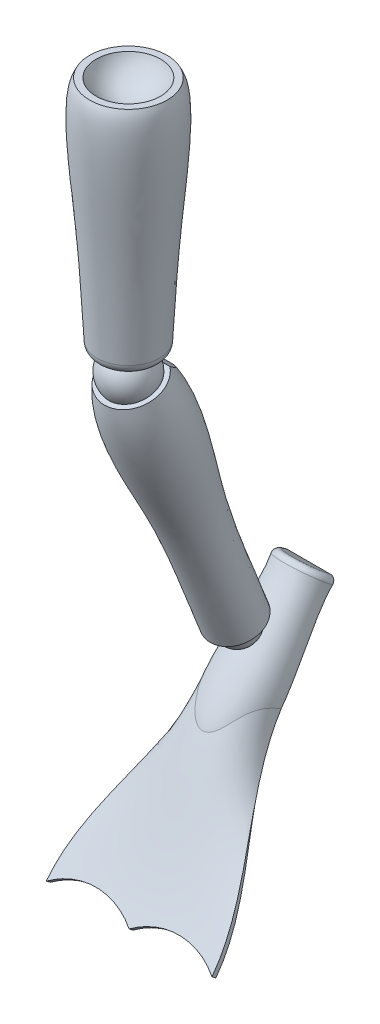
ISO-10303-21;
HEADER;
FILE_DESCRIPTION(('STEP AP214'),'2;1');
FILE_NAME('part.step','',(''),(''),'','','');
FILE_SCHEMA(('AUTOMOTIVE_DESIGN { 1 0 10303 214 1 1 1 1 }'));
ENDSEC;
DATA;
#1=APPLICATION_CONTEXT('core data for automotive mechanical design processes');
#2=APPLICATION_PROTOCOL_DEFINITION('international standard','automotive_design',2000,#1);
#3=PRODUCT_CONTEXT('',#1,'mechanical');
#4=PRODUCT('Part','Part','',(#3));
#5=PRODUCT_RELATED_PRODUCT_CATEGORY('part','',(#4));
#6=PRODUCT_DEFINITION_FORMATION('','',#4);
#7=PRODUCT_DEFINITION_CONTEXT('part definition',#1,'design');
#8=PRODUCT_DEFINITION('design','',#6,#7);
#9=PRODUCT_DEFINITION_SHAPE('','',#8);
#10=(LENGTH_UNIT() NAMED_UNIT(*) SI_UNIT(.MILLI.,.METRE.));
#11=(NAMED_UNIT(*) PLANE_ANGLE_UNIT() SI_UNIT($,.RADIAN.));
#12=(NAMED_UNIT(*) SI_UNIT($,.STERADIAN.) SOLID_ANGLE_UNIT());
#13=UNCERTAINTY_MEASURE_WITH_UNIT(LENGTH_MEASURE(1.E-05),#10,'distance_accuracy_value','');
#14=(GEOMETRIC_REPRESENTATION_CONTEXT(3) GLOBAL_UNCERTAINTY_ASSIGNED_CONTEXT((#13)) GLOBAL_UNIT_ASSIGNED_CONTEXT((#10,
#11,#12)) REPRESENTATION_CONTEXT('',''));
#15=CARTESIAN_POINT('',(0.,0.,0.));
#16=DIRECTION('',(0.,0.,1.));
#17=DIRECTION('',(1.,0.,0.));
#18=AXIS2_PLACEMENT_3D('',#15,#16,#17);
#19=CARTESIAN_POINT('',(0.0827990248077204,14.5314599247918,39.528658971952));
#20=DIRECTION('',(0.,1.,0.));
#21=DIRECTION('',(1.,0.,0.));
#22=AXIS2_PLACEMENT_3D('',#19,#20,#21);
#23=SPHERICAL_SURFACE('',#22,36.195);
#24=CARTESIAN_POINT('',(0.0827990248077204,12.8060903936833,37.378878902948));
#25=DIRECTION('',(0.,0.62592095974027,0.779886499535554));
#26=DIRECTION('',(0.,-0.779886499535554,0.62592095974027));
#27=AXIS2_PLACEMENT_3D('',#24,#25,#26);
#28=CIRCLE('',#27,36.0898818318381);
#29=CARTESIAN_POINT('',(-14.3286739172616,38.6106599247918,16.668658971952));
#30=VERTEX_POINT('',#29);
#31=CARTESIAN_POINT('',(14.4942719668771,38.6106599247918,16.668658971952));
#32=VERTEX_POINT('',#31);
#33=EDGE_CURVE('E11',#30,#32,#28,.F.);
#34=ORIENTED_EDGE('',*,*,#33,.T.);
#35=CARTESIAN_POINT('',(0.0827990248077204,38.6106599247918,39.528658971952));
#36=DIRECTION('',(0.,1.,0.));
#37=DIRECTION('',(0.,0.,1.));
#38=AXIS2_PLACEMENT_3D('',#35,#36,#37);
#39=CIRCLE('',#38,27.0235111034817);
#40=EDGE_CURVE('E407',#32,#30,#39,.F.);
#41=ORIENTED_EDGE('',*,*,#40,.T.);
#42=EDGE_LOOP('',(#34,#41));
#43=FACE_BOUND('',#42,.T.);
#44=CARTESIAN_POINT('',(0.0827990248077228,4.47968948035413,35.5232916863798));
#45=DIRECTION('',(0.,-0.928964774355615,-0.370168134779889));
#46=DIRECTION('',(0.,0.370168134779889,-0.928964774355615));
#47=AXIS2_PLACEMENT_3D('',#44,#45,#46);
#48=CIRCLE('',#47,34.539788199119);
#49=CARTESIAN_POINT('',(13.1449348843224,16.3156821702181,5.8199778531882));
#50=VERTEX_POINT('',#49);
#51=CARTESIAN_POINT('',(-12.9793368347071,16.3156821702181,5.8199778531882));
#52=VERTEX_POINT('',#51);
#53=EDGE_CURVE('E468',#50,#52,#48,.T.);
#54=ORIENTED_EDGE('',*,*,#53,.F.);
#55=CARTESIAN_POINT('',(0.0827990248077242,32.0326141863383,25.6750423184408));
#56=DIRECTION('',(0.,-0.784077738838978,0.620662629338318));
#57=DIRECTION('',(0.,-0.620662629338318,-0.784077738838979));
#58=AXIS2_PLACEMENT_3D('',#55,#56,#57);
#59=CIRCLE('',#58,28.4932435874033);
#60=EDGE_CURVE('E56',#50,#52,#59,.F.);
#61=ORIENTED_EDGE('',*,*,#60,.T.);
#62=EDGE_LOOP('',(#54,#61));
#63=FACE_BOUND('',#62,.T.);
#64=ADVANCED_FACE('F34',(#43,#63),#23,.T.);
#65=CARTESIAN_POINT('',(0.0827990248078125,38.6106599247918,39.528658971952));
#66=DIRECTION('',(0.,1.,0.));
#67=DIRECTION('',(0.,0.,1.));
#68=AXIS2_PLACEMENT_3D('',#65,#66,#67);
#69=PLANE('',#68);
#70=ORIENTED_EDGE('',*,*,#40,.F.);
#71=DIRECTION('',(1.,0.,0.));
#72=VECTOR('',#71,1.);
#73=CARTESIAN_POINT('',(-210.094745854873,38.6106599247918,16.668658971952));
#74=LINE('',#73,#72);
#75=CARTESIAN_POINT('',(19.3411096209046,38.6106599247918,16.668658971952));
#76=VERTEX_POINT('',#75);
#77=EDGE_CURVE('E457',#32,#76,#74,.T.);
#78=ORIENTED_EDGE('',*,*,#77,.T.);
#79=CARTESIAN_POINT('',(0.0827990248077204,38.6106599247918,39.528658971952));
#80=DIRECTION('',(0.,1.,0.));
#81=DIRECTION('',(0.,0.,1.));
#82=AXIS2_PLACEMENT_3D('',#79,#80,#81);
#83=CIRCLE('',#82,29.8908368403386);
#84=CARTESIAN_POINT('',(-19.1755115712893,38.6106599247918,16.668658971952));
#85=VERTEX_POINT('',#84);
#86=EDGE_CURVE('E416',#76,#85,#83,.F.);
#87=ORIENTED_EDGE('',*,*,#86,.T.);
#88=EDGE_CURVE('E438',#85,#30,#74,.T.);
#89=ORIENTED_EDGE('',*,*,#88,.T.);
#90=EDGE_LOOP('',(#70,#78,#87,#89));
#91=FACE_BOUND('',#90,.T.);
#92=ADVANCED_FACE('F424',(#91),#69,.F.);
#93=CARTESIAN_POINT('',(-210.094745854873,67.1856599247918,-6.26505181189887));
#94=DIRECTION('',(0.,0.62592095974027,0.779886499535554));
#95=DIRECTION('',(0.,-0.779886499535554,0.62592095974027));
#96=AXIS2_PLACEMENT_3D('',#93,#94,#95);
#97=PLANE('',#96);
#98=ORIENTED_EDGE('',*,*,#33,.F.);
#99=ORIENTED_EDGE('',*,*,#88,.F.);
#100=CARTESIAN_POINT('',(29.1412122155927,53.1245308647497,5.0201228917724));
#101=CARTESIAN_POINT('',(29.3860990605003,52.8459384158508,5.24371549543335));
#102=CARTESIAN_POINT('',(29.6191404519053,52.5608553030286,5.47251737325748));
#103=CARTESIAN_POINT('',(30.0587835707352,51.9780561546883,5.94026005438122));
#104=CARTESIAN_POINT('',(30.2653494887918,51.6803237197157,6.17921401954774));
#105=CARTESIAN_POINT('',(30.65041418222,51.0704840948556,6.66865883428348));
#106=CARTESIAN_POINT('',(30.8286322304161,50.7582684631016,6.91923671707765));
#107=CARTESIAN_POINT('',(31.1510298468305,50.123401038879,7.42876833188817));
#108=CARTESIAN_POINT('',(31.2952245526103,49.8007539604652,7.68771828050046));
#109=CARTESIAN_POINT('',(31.5200235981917,49.2139446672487,8.15867942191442));
#110=CARTESIAN_POINT('',(31.6076072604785,48.9514044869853,8.36938880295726));
#111=CARTESIAN_POINT('',(31.7568594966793,48.421947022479,8.7943205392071));
#112=CARTESIAN_POINT('',(31.8185386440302,48.1550315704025,9.00854142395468));
#113=CARTESIAN_POINT('',(31.9137662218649,47.6190063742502,9.43874428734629));
#114=CARTESIAN_POINT('',(31.9474040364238,47.3499063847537,9.65471843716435));
#115=CARTESIAN_POINT('',(31.9847870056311,46.810439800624,10.0876832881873));
#116=CARTESIAN_POINT('',(31.988538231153,46.5400734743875,10.3046737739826));
#117=CARTESIAN_POINT('',(31.9663896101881,46.0489033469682,10.6988768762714));
#118=CARTESIAN_POINT('',(31.9457142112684,45.8279530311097,10.8762070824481));
#119=CARTESIAN_POINT('',(31.8820119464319,45.3880347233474,11.229276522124));
#120=CARTESIAN_POINT('',(31.8389896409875,45.169066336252,11.4050160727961));
#121=CARTESIAN_POINT('',(31.72980449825,44.7345899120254,11.7537179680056));
#122=CARTESIAN_POINT('',(31.6636359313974,44.5190827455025,11.9266796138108));
#123=CARTESIAN_POINT('',(31.5076538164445,44.0933113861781,12.2683950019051));
#124=CARTESIAN_POINT('',(31.4178399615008,43.8830472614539,12.4371486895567));
#125=CARTESIAN_POINT('',(31.2138369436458,43.4684298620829,12.7699121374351));
#126=CARTESIAN_POINT('',(31.0995107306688,43.2641174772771,12.9338890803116));
#127=CARTESIAN_POINT('',(30.847095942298,42.8646080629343,13.2545271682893));
#128=CARTESIAN_POINT('',(30.7090073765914,42.6694110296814,13.4111883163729));
#129=CARTESIAN_POINT('',(30.4099641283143,42.2901187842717,13.7156005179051));
#130=CARTESIAN_POINT('',(30.2490220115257,42.1060175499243,13.8633564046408));
#131=CARTESIAN_POINT('',(29.9055480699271,41.7505152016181,14.1486753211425));
#132=CARTESIAN_POINT('',(29.7230178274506,41.5791131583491,14.2862390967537));
#133=CARTESIAN_POINT('',(29.3569951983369,41.2664895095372,14.5371444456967));
#134=CARTESIAN_POINT('',(29.1753395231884,41.1239553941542,14.6515394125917));
#135=CARTESIAN_POINT('',(28.7975214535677,40.8511458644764,14.8704907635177));
#136=CARTESIAN_POINT('',(28.6013605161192,40.7208692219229,14.9750481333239));
#137=CARTESIAN_POINT('',(28.1962043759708,40.4730151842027,15.1739707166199));
#138=CARTESIAN_POINT('',(27.9872058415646,40.355441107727,15.2683332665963));
#139=CARTESIAN_POINT('',(27.5581981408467,40.1331980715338,15.4467009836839));
#140=CARTESIAN_POINT('',(27.3381866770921,40.0285318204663,15.5307039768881));
#141=CARTESIAN_POINT('',(26.8152236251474,39.7997963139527,15.7142824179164));
#142=CARTESIAN_POINT('',(26.5087386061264,39.6806242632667,15.8099274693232));
#143=CARTESIAN_POINT('',(25.8833723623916,39.4640757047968,15.9837249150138));
#144=CARTESIAN_POINT('',(25.5644871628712,39.3667062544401,16.0618716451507));
#145=CARTESIAN_POINT('',(24.9176212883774,39.1923348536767,16.2018185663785));
#146=CARTESIAN_POINT('',(24.5896373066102,39.1153404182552,16.2636127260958));
#147=CARTESIAN_POINT('',(23.9275362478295,38.9800190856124,16.3722188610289));
#148=CARTESIAN_POINT('',(23.5934196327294,38.9216907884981,16.4190319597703));
#149=CARTESIAN_POINT('',(22.5376015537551,38.7647096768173,16.545021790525));
#150=CARTESIAN_POINT('',(21.8084589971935,38.6959368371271,16.600217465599));
#151=CARTESIAN_POINT('',(20.7114013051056,38.6359093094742,16.6483943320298));
#152=CARTESIAN_POINT('',(20.3447852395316,38.6230977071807,16.6586766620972));
#153=CARTESIAN_POINT('',(19.6111601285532,38.6096728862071,16.6694511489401));
#154=CARTESIAN_POINT('',(19.2441511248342,38.6090584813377,16.6699442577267));
#155=CARTESIAN_POINT('',(18.5071292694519,38.61800987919,16.6627600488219));
#156=CARTESIAN_POINT('',(18.1371187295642,38.6276662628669,16.6550100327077));
#157=CARTESIAN_POINT('',(17.3976202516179,38.6553633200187,16.6327809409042));
#158=CARTESIAN_POINT('',(17.028132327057,38.6734042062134,16.6183016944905));
#159=CARTESIAN_POINT('',(16.2900549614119,38.7160923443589,16.5840410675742));
#160=CARTESIAN_POINT('',(15.9214650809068,38.7407351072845,16.5642632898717));
#161=CARTESIAN_POINT('',(15.1848875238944,38.7950415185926,16.5206780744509));
#162=CARTESIAN_POINT('',(14.8168998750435,38.8247053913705,16.4968704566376));
#163=CARTESIAN_POINT('',(13.7409554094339,38.916684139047,16.4230501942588));
#164=CARTESIAN_POINT('',(13.0336874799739,38.9838004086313,16.3691840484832));
#165=CARTESIAN_POINT('',(11.6197907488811,39.1220959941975,16.2581908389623));
#166=CARTESIAN_POINT('',(10.9131620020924,39.1932756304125,16.2010635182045));
#167=CARTESIAN_POINT('',(9.49925202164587,39.3321722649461,16.0895879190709));
#168=CARTESIAN_POINT('',(8.79197073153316,39.3998889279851,16.0352399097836));
#169=CARTESIAN_POINT('',(7.37598895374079,39.5256305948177,15.9343222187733));
#170=CARTESIAN_POINT('',(6.66728854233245,39.5836561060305,15.8877521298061));
#171=CARTESIAN_POINT('',(5.25515074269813,39.684615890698,15.8067238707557));
#172=CARTESIAN_POINT('',(4.55173071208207,39.7276938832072,15.7721503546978));
#173=CARTESIAN_POINT('',(3.14344123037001,39.7961276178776,15.7172268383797));
#174=CARTESIAN_POINT('',(2.43857178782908,39.821483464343,15.6968767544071));
#175=CARTESIAN_POINT('',(1.02828404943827,39.8524961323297,15.6719866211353));
#176=CARTESIAN_POINT('',(0.322865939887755,39.8581579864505,15.6674425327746));
#177=CARTESIAN_POINT('',(-1.08775796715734,39.8493512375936,15.6745106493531));
#178=CARTESIAN_POINT('',(-1.79296376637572,39.8348828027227,15.6861227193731));
#179=CARTESIAN_POINT('',(-3.03783967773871,39.7925560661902,15.7200932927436));
#180=CARTESIAN_POINT('',(-3.57773865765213,39.7686099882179,15.7393119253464));
#181=CARTESIAN_POINT('',(-4.65663223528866,39.7106882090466,15.7857987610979));
#182=CARTESIAN_POINT('',(-5.19562685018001,39.6767127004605,15.8130668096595));
#183=CARTESIAN_POINT('',(-6.27279135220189,39.6003081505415,15.8743875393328));
#184=CARTESIAN_POINT('',(-6.81096091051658,39.5578763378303,15.908442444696));
#185=CARTESIAN_POINT('',(-7.8863968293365,39.4666252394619,15.9816787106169));
#186=CARTESIAN_POINT('',(-8.42366318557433,39.4178059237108,16.0208600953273));
#187=CARTESIAN_POINT('',(-9.50045563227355,39.3160041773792,16.1025640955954));
#188=CARTESIAN_POINT('',(-10.0399784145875,39.2630008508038,16.1451034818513));
#189=CARTESIAN_POINT('',(-11.118881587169,39.1560375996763,16.2309500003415));
#190=CARTESIAN_POINT('',(-11.6582619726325,39.1020776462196,16.2742571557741));
#191=CARTESIAN_POINT('',(-12.7372478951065,38.99666050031,16.3588628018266));
#192=CARTESIAN_POINT('',(-13.2768532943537,38.9452024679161,16.4001619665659));
#193=CARTESIAN_POINT('',(-14.3569958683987,38.8487146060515,16.4776011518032));
#194=CARTESIAN_POINT('',(-14.8975329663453,38.8036842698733,16.5137415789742));
#195=CARTESIAN_POINT('',(-15.9246806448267,38.7286202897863,16.5739863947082));
#196=CARTESIAN_POINT('',(-16.4111595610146,38.6975246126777,16.5989431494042));
#197=CARTESIAN_POINT('',(-17.3852961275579,38.647910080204,16.638762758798));
#198=CARTESIAN_POINT('',(-17.8729539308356,38.6293929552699,16.6536242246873));
#199=CARTESIAN_POINT('',(-18.8484567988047,38.6091977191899,16.6698325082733));
#200=CARTESIAN_POINT('',(-19.3363012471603,38.6075036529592,16.6711921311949));
#201=CARTESIAN_POINT('',(-20.3113717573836,38.6256904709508,16.6565957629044));
#202=CARTESIAN_POINT('',(-20.798597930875,38.6455666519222,16.6406435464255));
#203=CARTESIAN_POINT('',(-21.6757930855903,38.705713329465,16.5923710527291));
#204=CARTESIAN_POINT('',(-22.0662801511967,38.7412754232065,16.5638296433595));
#205=CARTESIAN_POINT('',(-22.8434414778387,38.8328074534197,16.4903679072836));
#206=CARTESIAN_POINT('',(-23.2301154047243,38.8887791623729,16.4454461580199));
#207=CARTESIAN_POINT('',(-23.9961449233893,39.0239973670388,16.3369227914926));
#208=CARTESIAN_POINT('',(-24.375511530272,39.1032053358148,16.2733520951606));
#209=CARTESIAN_POINT('',(-25.1236771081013,39.2877173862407,16.1252664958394));
#210=CARTESIAN_POINT('',(-25.4924806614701,39.3930099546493,16.0407608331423));
#211=CARTESIAN_POINT('',(-26.110475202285,39.5974675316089,15.8766673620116));
#212=CARTESIAN_POINT('',(-26.3634832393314,39.6896396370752,15.8026919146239));
#213=CARTESIAN_POINT('',(-26.8596389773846,39.8888791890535,15.6427863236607));
#214=CARTESIAN_POINT('',(-27.1027893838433,39.9959425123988,15.5568594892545));
#215=CARTESIAN_POINT('',(-27.5769860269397,40.2252044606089,15.3728585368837));
#216=CARTESIAN_POINT('',(-27.8080362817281,40.3473980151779,15.274788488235));
#217=CARTESIAN_POINT('',(-28.2558307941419,40.6068479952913,15.0665592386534));
#218=CARTESIAN_POINT('',(-28.4725748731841,40.74410460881,14.956399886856));
#219=CARTESIAN_POINT('',(-28.8907756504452,41.0340566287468,14.7236903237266));
#220=CARTESIAN_POINT('',(-29.0921309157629,41.1868411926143,14.6010685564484));
#221=CARTESIAN_POINT('',(-29.475977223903,41.5062171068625,14.3447439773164));
#222=CARTESIAN_POINT('',(-29.6584681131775,41.6728085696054,14.2110410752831));
#223=CARTESIAN_POINT('',(-30.0028103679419,42.0184971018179,13.9335985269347));
#224=CARTESIAN_POINT('',(-30.1646617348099,42.1975941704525,13.7898588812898));
#225=CARTESIAN_POINT('',(-30.4663772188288,42.5667061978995,13.4936171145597));
#226=CARTESIAN_POINT('',(-30.6062424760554,42.756720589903,13.3411154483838));
#227=CARTESIAN_POINT('',(-30.8520067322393,43.129042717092,13.0422973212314));
#228=CARTESIAN_POINT('',(-30.9597978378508,43.3105939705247,12.8965879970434));
#229=CARTESIAN_POINT('',(-31.1560624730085,43.6800045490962,12.6001066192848));
#230=CARTESIAN_POINT('',(-31.2445294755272,43.8678659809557,12.4493328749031));
#231=CARTESIAN_POINT('',(-31.4020691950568,44.2483874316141,12.1439341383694));
#232=CARTESIAN_POINT('',(-31.471148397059,44.4410458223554,11.9893104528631));
#233=CARTESIAN_POINT('',(-31.5902392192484,44.8299711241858,11.6771669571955));
#234=CARTESIAN_POINT('',(-31.6402436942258,45.0262393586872,11.5196460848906));
#235=CARTESIAN_POINT('',(-31.7241072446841,45.4331842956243,11.1930403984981));
#236=CARTESIAN_POINT('',(-31.7567923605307,45.6440083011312,11.023837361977));
#237=CARTESIAN_POINT('',(-31.8019530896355,46.0669930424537,10.6843584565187));
#238=CARTESIAN_POINT('',(-31.8144207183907,46.2791542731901,10.5140821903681));
#239=CARTESIAN_POINT('',(-31.8227595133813,46.9159078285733,10.0030368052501));
#240=CARTESIAN_POINT('',(-31.7895960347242,47.3409201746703,9.6619305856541));
#241=CARTESIAN_POINT('',(-31.6718532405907,48.0715623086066,9.07553214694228));
#242=CARTESIAN_POINT('',(-31.6032694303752,48.378918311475,8.8288545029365));
#243=CARTESIAN_POINT('',(-31.4318361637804,48.9879193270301,8.34008273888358));
#244=CARTESIAN_POINT('',(-31.3289721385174,49.2895618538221,8.09799061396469));
#245=CARTESIAN_POINT('',(-31.0918805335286,49.8857605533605,7.61949372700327));
#246=CARTESIAN_POINT('',(-30.9575986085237,50.1803034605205,7.38309961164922));
#247=CARTESIAN_POINT('',(-30.6606823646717,50.7605804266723,6.91738118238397));
#248=CARTESIAN_POINT('',(-30.4980422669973,51.0463126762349,6.68805832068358));
#249=CARTESIAN_POINT('',(-30.1269525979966,51.64028548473,6.2113478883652));
#250=CARTESIAN_POINT('',(-29.9153874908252,51.9473440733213,5.96490894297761));
#251=CARTESIAN_POINT('',(-29.5774227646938,52.397206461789,5.60385858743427));
#252=CARTESIAN_POINT('',(-29.4616929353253,52.5449643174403,5.48527115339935));
#253=CARTESIAN_POINT('',(-29.2235629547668,52.8372145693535,5.25071707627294));
#254=CARTESIAN_POINT('',(-29.1011615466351,52.9817063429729,5.13475093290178));
#255=CARTESIAN_POINT('',(-28.9756141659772,53.1245308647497,5.0201228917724));
#256=B_SPLINE_CURVE_WITH_KNOTS('',3,(#100,#101,#102,#103,#104,#105,#106,#107,#108,#109,#110,
#111,#112,#113,#114,#115,#116,#117,#118,#119,#120,#121,#122,#123,#124,#125,#126,#127,#128,#129,
#130,#131,#132,#133,#134,#135,#136,#137,#138,#139,#140,#141,#142,#143,#144,#145,#146,#147,#148,
#149,#150,#151,#152,#153,#154,#155,#156,#157,#158,#159,#160,#161,#162,#163,#164,#165,#166,#167,
#168,#169,#170,#171,#172,#173,#174,#175,#176,#177,#178,#179,#180,#181,#182,#183,#184,#185,#186,
#187,#188,#189,#190,#191,#192,#193,#194,#195,#196,#197,#198,#199,#200,#201,#202,#203,#204,#205,
#206,#207,#208,#209,#210,#211,#212,#213,#214,#215,#216,#217,#218,#219,#220,#221,#222,#223,#224,
#225,#226,#227,#228,#229,#230,#231,#232,#233,#234,#235,#236,#237,#238,#239,#240,#241,#242,#243,
#244,#245,#246,#247,#248,#249,#250,#251,#252,#253,#254,#255),.UNSPECIFIED.,.F.,.F.,(4,2,2,2,2,2,
2,2,2,2,2,2,2,2,2,2,2,2,2,2,2,2,2,2,2,2,2,2,2,2,2,2,2,2,2,2,2,2,2,2,2,2,2,2,2,2,2,2,2,2,2,2,2,2,
2,2,2,2,2,2,2,2,2,2,2,2,2,2,2,2,2,2,2,2,2,2,2,4),(0.,1.29931364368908,2.60036653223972,
3.91359408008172,5.22623624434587,6.26886137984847,7.31106053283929,8.34992474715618,
9.38857793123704,10.2399507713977,11.09114993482,11.9425599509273,12.7939810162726,
13.6502927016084,14.5066040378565,15.3624463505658,16.2182259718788,16.9903864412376,
17.7624694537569,18.5347536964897,19.3071997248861,20.3330233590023,21.3591785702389,
22.3857117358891,23.4121678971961,25.6092986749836,26.7100952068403,27.8107846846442,
28.9212625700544,30.0317686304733,31.1415214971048,32.2513239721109,34.3886727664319,
36.5261902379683,38.6639142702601,40.8015263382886,42.9179756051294,45.0344124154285,
47.1503083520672,49.2661866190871,50.8883394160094,52.5104610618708,54.1331152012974,
55.7557769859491,57.3871292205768,59.018530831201,60.649380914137,62.2801023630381,
63.744246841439,65.2085927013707,66.671549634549,68.1341876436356,69.3128737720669,
70.4916622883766,71.6685072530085,72.8448337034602,73.6818552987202,74.5186455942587,
75.3551562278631,76.1916773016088,77.0333065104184,77.8749425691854,78.7165785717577,
79.5581709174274,80.3269196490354,81.0959276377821,81.864678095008,82.6337162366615,
83.449770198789,84.2661463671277,85.8983197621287,87.0969880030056,88.2961663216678,
89.4974344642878,90.6989476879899,92.0384015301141,92.7043183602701,93.3703610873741),.UNSPECIFIED.);
#257=CARTESIAN_POINT('',(-28.9766689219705,53.1233308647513,5.02108598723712));
#258=VERTEX_POINT('',#257);
#259=EDGE_CURVE('E409',#85,#258,#256,.T.);
#260=ORIENTED_EDGE('',*,*,#259,.T.);
#261=CARTESIAN_POINT('',(29.142266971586,53.1233308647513,5.02108598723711));
#262=CARTESIAN_POINT('',(28.6858690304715,53.6425915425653,4.60433798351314));
#263=CARTESIAN_POINT('',(28.2160932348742,54.1547952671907,4.19325374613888));
#264=CARTESIAN_POINT('',(27.2480465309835,55.164081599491,3.3832211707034));
#265=CARTESIAN_POINT('',(26.7497223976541,55.6611331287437,2.98429777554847));
#266=CARTESIAN_POINT('',(25.7242586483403,56.6374084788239,2.200759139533));
#267=CARTESIAN_POINT('',(25.1971003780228,57.1166204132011,1.81615343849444));
#268=CARTESIAN_POINT('',(24.1068500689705,58.060315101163,1.05876337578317));
#269=CARTESIAN_POINT('',(23.5433951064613,58.5245433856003,0.686183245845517));
#270=CARTESIAN_POINT('',(22.3862028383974,59.428986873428,-0.0397046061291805));
#271=CARTESIAN_POINT('',(21.7924828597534,59.8692155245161,-0.3930231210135));
#272=CARTESIAN_POINT('',(20.5743014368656,60.7226868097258,-1.07800172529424));
#273=CARTESIAN_POINT('',(19.9498512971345,61.135939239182,-1.40966967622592));
#274=CARTESIAN_POINT('',(18.5838383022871,61.9857434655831,-2.09170517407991));
#275=CARTESIAN_POINT('',(17.8378159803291,62.4179605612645,-2.43859377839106));
#276=CARTESIAN_POINT('',(16.3064130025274,63.237906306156,-3.09666546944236));
#277=CARTESIAN_POINT('',(15.5210308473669,63.6256332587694,-3.40784719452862));
#278=CARTESIAN_POINT('',(13.9160599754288,64.3489933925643,-3.9884012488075));
#279=CARTESIAN_POINT('',(13.096630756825,64.6848408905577,-4.25794558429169));
#280=CARTESIAN_POINT('',(11.4236327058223,65.3001476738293,-4.75177822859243));
#281=CARTESIAN_POINT('',(10.57007026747,65.5796174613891,-4.97607496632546));
#282=CARTESIAN_POINT('',(8.96740675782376,66.0378829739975,-5.34386949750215));
#283=CARTESIAN_POINT('',(8.22247315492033,66.2255556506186,-5.49449175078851));
#284=CARTESIAN_POINT('',(6.71545559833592,66.5529544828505,-5.75725535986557));
#285=CARTESIAN_POINT('',(5.95337330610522,66.6926852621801,-5.8694004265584));
#286=CARTESIAN_POINT('',(4.41657011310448,66.921532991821,-6.05306893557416));
#287=CARTESIAN_POINT('',(3.64184611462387,67.0106373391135,-6.12458226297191));
#288=CARTESIAN_POINT('',(2.08536967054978,67.1363370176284,-6.22546625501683));
#289=CARTESIAN_POINT('',(1.30361702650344,67.172930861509,-6.25483572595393));
#290=CARTESIAN_POINT('',(-0.26200519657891,67.1928286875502,-6.27080531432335));
#291=CARTESIAN_POINT('',(-1.04587620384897,67.1760646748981,-6.25735086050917));
#292=CARTESIAN_POINT('',(-2.60870104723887,67.0894652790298,-6.18784795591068));
#293=CARTESIAN_POINT('',(-3.38765525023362,67.0196339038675,-6.13180272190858));
#294=CARTESIAN_POINT('',(-4.9350050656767,66.8283848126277,-5.97831011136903));
#295=CARTESIAN_POINT('',(-5.70340103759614,66.706968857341,-5.8808641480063));
#296=CARTESIAN_POINT('',(-7.22488442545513,66.4149240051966,-5.64647492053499));
#297=CARTESIAN_POINT('',(-7.97796626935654,66.2442775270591,-5.50951754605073));
#298=CARTESIAN_POINT('',(-9.45646833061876,65.8589712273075,-5.20027858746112));
#299=CARTESIAN_POINT('',(-10.1820965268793,65.6447946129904,-5.02838481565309));
#300=CARTESIAN_POINT('',(-11.6110215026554,65.1747226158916,-4.65111464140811));
#301=CARTESIAN_POINT('',(-12.3143098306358,64.9188116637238,-4.44572574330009));
#302=CARTESIAN_POINT('',(-13.6966012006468,64.3687088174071,-4.00422444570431));
#303=CARTESIAN_POINT('',(-14.3755797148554,64.0744795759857,-3.76808207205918));
#304=CARTESIAN_POINT('',(-15.7071317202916,63.4515023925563,-3.26809332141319));
#305=CARTESIAN_POINT('',(-16.3596989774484,63.1227463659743,-3.00424045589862));
#306=CARTESIAN_POINT('',(-17.5039238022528,62.506175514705,-2.50939329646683));
#307=CARTESIAN_POINT('',(-18.0007331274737,62.2241415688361,-2.28303861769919));
#308=CARTESIAN_POINT('',(-18.9768428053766,61.6423849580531,-1.81613265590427));
#309=CARTESIAN_POINT('',(-19.4561459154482,61.3426650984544,-1.57558362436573));
#310=CARTESIAN_POINT('',(-20.8671950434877,60.4196119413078,-0.834760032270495));
#311=CARTESIAN_POINT('',(-21.7729495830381,59.7719117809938,-0.314929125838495));
#312=CARTESIAN_POINT('',(-23.5164397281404,58.4220105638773,0.768473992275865));
#313=CARTESIAN_POINT('',(-24.3540924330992,57.7197450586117,1.33209792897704));
#314=CARTESIAN_POINT('',(-25.9625397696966,56.2703793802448,2.4953291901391));
#315=CARTESIAN_POINT('',(-26.7333477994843,55.5232882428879,3.09492926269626));
#316=CARTESIAN_POINT('',(-27.7308525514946,54.4893345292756,3.92475937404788));
#317=CARTESIAN_POINT('',(-27.9857490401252,54.2187531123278,4.14192248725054));
#318=CARTESIAN_POINT('',(-28.4872291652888,53.6738977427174,4.57921226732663));
#319=CARTESIAN_POINT('',(-28.7338307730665,53.3996338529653,4.79933085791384));
#320=CARTESIAN_POINT('',(-28.9766689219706,53.1233308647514,5.02108598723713));
#321=B_SPLINE_CURVE_WITH_KNOTS('',3,(#261,#262,#263,#264,#265,#266,#267,#268,#269,#270,#271,
#272,#273,#274,#275,#276,#277,#278,#279,#280,#281,#282,#283,#284,#285,#286,#287,#288,#289,#290,
#291,#292,#293,#294,#295,#296,#297,#298,#299,#300,#301,#302,#303,#304,#305,#306,#307,#308,#309,
#310,#311,#312,#313,#314,#315,#316,#317,#318,#319,#320),.UNSPECIFIED.,.F.,.F.,(4,2,2,2,2,2,2,2,
2,2,2,2,2,2,2,2,2,2,2,2,2,2,2,2,2,2,2,2,2,4),(0.,2.42165777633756,4.84798747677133,
7.27590590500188,9.73376095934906,12.1902243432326,14.6457907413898,17.4314246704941,
20.2171647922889,22.991069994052,25.7644579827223,28.1105441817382,30.4564040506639,
32.8028476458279,35.149357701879,37.4988591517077,39.8481831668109,42.1974269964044,
44.5475108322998,46.8728075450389,49.1989737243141,51.5274243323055,53.8564213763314,
55.6992089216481,57.5417049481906,61.2235295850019,64.9097710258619,68.5952718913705,
69.8867580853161,71.1752376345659),.UNSPECIFIED.);
#322=CARTESIAN_POINT('',(29.142266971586,53.1233308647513,5.02108598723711));
#323=VERTEX_POINT('',#322);
#324=EDGE_CURVE('E432',#323,#258,#321,.T.);
#325=ORIENTED_EDGE('',*,*,#324,.F.);
#326=EDGE_CURVE('E49',#323,#76,#256,.T.);
#327=ORIENTED_EDGE('',*,*,#326,.T.);
#328=ORIENTED_EDGE('',*,*,#77,.F.);
#329=EDGE_LOOP('',(#98,#99,#260,#325,#327,#328));
#330=FACE_BOUND('',#329,.T.);
#331=ADVANCED_FACE('F418',(#330),#97,.F.);
#332=CARTESIAN_POINT('',(0.0827990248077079,380.291459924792,39.528658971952));
#333=DIRECTION('',(0.,-1.,0.));
#334=DIRECTION('',(0.,0.,-1.));
#335=AXIS2_PLACEMENT_3D('',#332,#333,#334);
#336=PLANE('',#335);
#337=CARTESIAN_POINT('',(0.0827990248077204,380.291459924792,39.528658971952));
#338=DIRECTION('',(0.,-1.,0.));
#339=DIRECTION('',(0.,0.,-1.));
#340=AXIS2_PLACEMENT_3D('',#337,#338,#339);
#341=CIRCLE('',#340,46.3135551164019);
#342=CARTESIAN_POINT('',(0.0827990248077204,380.291459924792,-6.78489614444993));
#343=VERTEX_POINT('',#342);
#344=EDGE_CURVE('E405',#343,#343,#341,.T.);
#345=ORIENTED_EDGE('',*,*,#344,.T.);
#346=EDGE_LOOP('',(#345));
#347=FACE_BOUND('',#346,.T.);
#348=CARTESIAN_POINT('',(0.0827990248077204,380.291459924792,39.528658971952));
#349=DIRECTION('',(0.,1.,0.));
#350=DIRECTION('',(0.,0.,1.));
#351=AXIS2_PLACEMENT_3D('',#348,#349,#350);
#352=CIRCLE('',#351,55.8546);
#353=CARTESIAN_POINT('',(0.0827990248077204,380.291459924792,95.383258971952));
#354=VERTEX_POINT('',#353);
#355=EDGE_CURVE('E437',#354,#354,#352,.T.);
#356=ORIENTED_EDGE('',*,*,#355,.T.);
#357=EDGE_LOOP('',(#356));
#358=FACE_BOUND('',#357,.T.);
#359=ADVANCED_FACE('F423',(#347,#358),#336,.F.);
#360=CARTESIAN_POINT('',(44.5073990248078,38.6106599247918,39.528658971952));
#361=CARTESIAN_POINT('',(46.9377117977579,89.9804686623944,39.528658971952));
#362=CARTESIAN_POINT('',(51.5682557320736,187.856823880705,39.528658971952));
#363=CARTESIAN_POINT('',(69.8183147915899,353.290855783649,39.528658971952));
#364=CARTESIAN_POINT('',(57.1683897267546,377.896985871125,39.528658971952));
#365=CARTESIAN_POINT('',(55.9373990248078,380.291459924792,39.528658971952));
#366=B_SPLINE_CURVE_WITH_KNOTS('',3,(#360,#361,#362,#363,#364,#365),.UNSPECIFIED.,.F.,.F.,(4,1,
1,4),(0.,0.499269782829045,0.951272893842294,1.),.UNSPECIFIED.);
#367=CARTESIAN_POINT('',(0.0827990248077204,790.874541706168,39.528658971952));
#368=DIRECTION('',(0.,1.,0.));
#369=AXIS1_PLACEMENT('',#367,#368);
#370=SURFACE_OF_REVOLUTION('',#366,#369);
#371=CARTESIAN_POINT('',(0.0827990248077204,53.1233308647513,39.528658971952));
#372=DIRECTION('',(0.,1.,0.));
#373=DIRECTION('',(0.,0.,1.));
#374=AXIS2_PLACEMENT_3D('',#371,#372,#373);
#375=CIRCLE('',#374,45.1134710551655);
#376=EDGE_CURVE('E448',#258,#323,#375,.T.);
#377=ORIENTED_EDGE('',*,*,#376,.T.);
#378=ORIENTED_EDGE('',*,*,#324,.T.);
#379=EDGE_LOOP('',(#377,#378));
#380=FACE_BOUND('',#379,.T.);
#381=ORIENTED_EDGE('',*,*,#355,.F.);
#382=EDGE_LOOP('',(#381));
#383=FACE_BOUND('',#382,.T.);
#384=ADVANCED_FACE('F426',(#380,#383),#370,.T.);
#385=CARTESIAN_POINT('',(0.0827990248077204,53.8506599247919,39.528658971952));
#386=DIRECTION('',(0.,1.,0.));
#387=DIRECTION('',(0.,0.,1.));
#388=AXIS2_PLACEMENT_3D('',#385,#386,#387);
#389=TOROIDAL_SURFACE('',#388,29.8908368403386,15.24);
#390=ORIENTED_EDGE('',*,*,#326,.F.);
#391=ORIENTED_EDGE('',*,*,#376,.F.);
#392=ORIENTED_EDGE('',*,*,#259,.F.);
#393=ORIENTED_EDGE('',*,*,#86,.F.);
#394=EDGE_LOOP('',(#390,#391,#392,#393));
#395=FACE_BOUND('',#394,.T.);
#396=ADVANCED_FACE('F36',(#395),#389,.T.);
#397=CARTESIAN_POINT('',(0.0827990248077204,398.274659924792,39.528658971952));
#398=DIRECTION('',(0.,-1.,0.));
#399=DIRECTION('',(-1.,0.,0.));
#400=AXIS2_PLACEMENT_3D('',#397,#398,#399);
#401=SPHERICAL_SURFACE('',#400,49.6824);
#402=ORIENTED_EDGE('',*,*,#344,.F.);
#403=EDGE_LOOP('',(#402));
#404=FACE_BOUND('',#403,.T.);
#405=ADVANCED_FACE('F497',(#404),#401,.F.);
#406=CARTESIAN_POINT('',(0.0827990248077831,-369.134707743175,-113.352261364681));
#407=DIRECTION('',(0.,0.928964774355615,0.370168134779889));
#408=DIRECTION('',(0.,-0.370168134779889,0.928964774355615));
#409=AXIS2_PLACEMENT_3D('',#406,#407,#408);
#410=PLANE('',#409);
#411=CARTESIAN_POINT('',(0.0827990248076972,-369.134707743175,-113.352261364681));
#412=DIRECTION('',(0.,0.928964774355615,0.370168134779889));
#413=DIRECTION('',(0.,-0.370168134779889,0.928964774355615));
#414=AXIS2_PLACEMENT_3D('',#411,#412,#413);
#415=CIRCLE('',#414,37.4904000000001);
#416=CARTESIAN_POINT('',(0.0827990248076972,-383.012459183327,-78.5250003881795));
#417=VERTEX_POINT('',#416);
#418=EDGE_CURVE('E465',#417,#417,#415,.T.);
#419=ORIENTED_EDGE('',*,*,#418,.F.);
#420=EDGE_LOOP('',(#419));
#421=FACE_BOUND('',#420,.T.);
#422=CARTESIAN_POINT('',(0.0827990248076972,-369.134707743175,-113.352261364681));
#423=DIRECTION('',(0.,0.928964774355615,0.370168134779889));
#424=DIRECTION('',(0.,-0.370168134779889,0.928964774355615));
#425=AXIS2_PLACEMENT_3D('',#422,#423,#424);
#426=CIRCLE('',#425,25.4845429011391);
#427=CARTESIAN_POINT('',(0.0827990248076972,-378.568273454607,-89.6780187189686));
#428=VERTEX_POINT('',#427);
#429=EDGE_CURVE('E224',#428,#428,#426,.F.);
#430=ORIENTED_EDGE('',*,*,#429,.F.);
#431=EDGE_LOOP('',(#430));
#432=FACE_BOUND('',#431,.T.);
#433=ADVANCED_FACE('F499',(#421,#432),#410,.F.);
#434=CARTESIAN_POINT('',(0.0827990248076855,4.47968948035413,35.5232916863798));
#435=DIRECTION('',(0.,-0.928964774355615,-0.370168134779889));
#436=DIRECTION('',(0.,0.370168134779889,-0.928964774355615));
#437=AXIS2_PLACEMENT_3D('',#434,#435,#436);
#438=PLANE('',#437);
#439=CARTESIAN_POINT('',(0.0827990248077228,4.47968948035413,35.5232916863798));
#440=DIRECTION('',(0.,0.928964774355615,0.370168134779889));
#441=DIRECTION('',(0.,-0.370168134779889,0.928964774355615));
#442=AXIS2_PLACEMENT_3D('',#439,#440,#441);
#443=CIRCLE('',#442,41.3004);
#444=CARTESIAN_POINT('',(-26.0580782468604,16.3156821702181,5.81997785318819));
#445=VERTEX_POINT('',#444);
#446=CARTESIAN_POINT('',(26.2236762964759,16.3156821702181,5.81997785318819));
#447=VERTEX_POINT('',#446);
#448=EDGE_CURVE('E471',#445,#447,#443,.T.);
#449=ORIENTED_EDGE('',*,*,#448,.T.);
#450=DIRECTION('',(-1.,0.,0.));
#451=VECTOR('',#450,1.);
#452=CARTESIAN_POINT('',(0.0827990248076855,16.3156821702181,5.81997785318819));
#453=LINE('',#452,#451);
#454=EDGE_CURVE('E215',#447,#50,#453,.T.);
#455=ORIENTED_EDGE('',*,*,#454,.T.);
#456=ORIENTED_EDGE('',*,*,#53,.T.);
#457=EDGE_CURVE('E209',#52,#445,#453,.T.);
#458=ORIENTED_EDGE('',*,*,#457,.T.);
#459=EDGE_LOOP('',(#449,#455,#456,#458));
#460=FACE_BOUND('',#459,.T.);
#461=ADVANCED_FACE('F477',(#460),#438,.F.);
#462=CARTESIAN_POINT('',(37.5731990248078,-369.134707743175,-113.352261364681));
#463=CARTESIAN_POINT('',(37.5825825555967,-354.513340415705,-107.526029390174));
#464=CARTESIAN_POINT('',(37.6189181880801,-297.895352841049,-84.965244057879));
#465=CARTESIAN_POINT('',(36.9404305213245,-198.038040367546,-45.1747201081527));
#466=CARTESIAN_POINT('',(55.2646201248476,-94.0816306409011,-3.750813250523));
#467=CARTESIAN_POINT('',(50.6089255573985,-25.005142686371,23.774358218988));
#468=CARTESIAN_POINT('',(42.9790591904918,-0.620577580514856,33.4909688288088));
#469=CARTESIAN_POINT('',(41.3831990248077,4.47968948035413,35.5232916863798));
#470=B_SPLINE_CURVE_WITH_KNOTS('',3,(#462,#463,#464,#465,#466,#467,#468,#469),.UNSPECIFIED.,.F.,
.F.,(4,1,1,1,1,4),(0.,0.117019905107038,0.453133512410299,0.796967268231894,0.95753374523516,
1.),.UNSPECIFIED.);
#471=CARTESIAN_POINT('',(0.0827990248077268,64.2749494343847,59.350136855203));
#472=DIRECTION('',(0.,0.928964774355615,0.370168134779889));
#473=AXIS1_PLACEMENT('',#471,#472);
#474=SURFACE_OF_REVOLUTION('',#470,#473);
#475=ORIENTED_EDGE('',*,*,#448,.F.);
#476=CARTESIAN_POINT('',(-26.0580782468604,16.3156821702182,5.81997785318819));
#477=CARTESIAN_POINT('',(-25.9344048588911,15.9533728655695,5.36227563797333));
#478=CARTESIAN_POINT('',(-25.806450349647,15.5916158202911,4.90527108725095));
#479=CARTESIAN_POINT('',(-25.5409685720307,14.8694215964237,3.99292936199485));
#480=CARTESIAN_POINT('',(-25.4034403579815,14.5089845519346,3.53759235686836));
#481=CARTESIAN_POINT('',(-25.11666307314,13.7867920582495,2.62525281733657));
#482=CARTESIAN_POINT('',(-24.9673277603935,13.4250497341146,2.16826686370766));
#483=CARTESIAN_POINT('',(-24.6568171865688,12.7035418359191,1.25679216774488));
#484=CARTESIAN_POINT('',(-24.4956422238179,12.3437762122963,0.802303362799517));
#485=CARTESIAN_POINT('',(-23.9915938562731,11.2658141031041,-0.55947685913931));
#486=CARTESIAN_POINT('',(-23.6290348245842,10.5511015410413,-1.46236706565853));
#487=CARTESIAN_POINT('',(-22.8344837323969,9.12292078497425,-3.2665754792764));
#488=CARTESIAN_POINT('',(-22.4014206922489,8.40967824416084,-4.16760862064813));
#489=CARTESIAN_POINT('',(-21.6948339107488,7.35562235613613,-5.49918831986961));
#490=CARTESIAN_POINT('',(-21.4501442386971,7.00732641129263,-5.93918757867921));
#491=CARTESIAN_POINT('',(-20.9400425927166,6.31658701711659,-6.81179268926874));
#492=CARTESIAN_POINT('',(-20.6746299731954,5.97414375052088,-7.24439831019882));
#493=CARTESIAN_POINT('',(-20.1220520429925,5.2968830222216,-8.09997593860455));
#494=CARTESIAN_POINT('',(-19.8349287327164,4.96205238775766,-8.52296458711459));
#495=CARTESIAN_POINT('',(-19.2368998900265,4.30069188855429,-9.35845559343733));
#496=CARTESIAN_POINT('',(-18.9259975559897,3.97416091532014,-9.77095935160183));
#497=CARTESIAN_POINT('',(-18.4277613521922,3.47832395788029,-10.3973458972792));
#498=CARTESIAN_POINT('',(-18.2491761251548,3.3056150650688,-10.615527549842));
#499=CARTESIAN_POINT('',(-17.8846157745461,2.96323949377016,-11.048047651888));
#500=CARTESIAN_POINT('',(-17.6986409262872,2.79357270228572,-11.2623862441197));
#501=CARTESIAN_POINT('',(-17.1292999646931,2.28940345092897,-11.8992989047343));
#502=CARTESIAN_POINT('',(-16.7345750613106,1.95978971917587,-12.3156970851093));
#503=CARTESIAN_POINT('',(-15.9147476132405,1.31665338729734,-13.1281656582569));
#504=CARTESIAN_POINT('',(-15.4897166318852,1.00309569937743,-13.5242803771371));
#505=CARTESIAN_POINT('',(-14.6074927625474,0.393884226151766,-14.2938919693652));
#506=CARTESIAN_POINT('',(-14.1503020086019,0.0982292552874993,-14.6673903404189));
#507=CARTESIAN_POINT('',(-13.197834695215,-0.475241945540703,-15.3918515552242));
#508=CARTESIAN_POINT('',(-12.7021960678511,-0.752827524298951,-15.7425230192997));
#509=CARTESIAN_POINT('',(-11.6769908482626,-1.28291535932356,-16.4121784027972));
#510=CARTESIAN_POINT('',(-11.1474207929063,-1.53541504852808,-16.7311590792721));
#511=CARTESIAN_POINT('',(-10.0555314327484,-2.01085453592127,-17.3317776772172));
#512=CARTESIAN_POINT('',(-9.49324565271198,-2.23382385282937,-17.6134528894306));
#513=CARTESIAN_POINT('',(-8.33729925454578,-2.64584140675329,-18.1339511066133));
#514=CARTESIAN_POINT('',(-7.74365081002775,-2.83490268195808,-18.372790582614));
#515=CARTESIAN_POINT('',(-6.68574132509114,-3.13042891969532,-18.7461263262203));
#516=CARTESIAN_POINT('',(-6.22776885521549,-3.24560585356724,-18.8916283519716));
#517=CARTESIAN_POINT('',(-5.29845750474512,-3.45289682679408,-19.15349724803));
#518=CARTESIAN_POINT('',(-4.82712055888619,-3.54501418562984,-19.2698683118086));
#519=CARTESIAN_POINT('',(-3.87400240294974,-3.70446753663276,-19.4713043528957));
#520=CARTESIAN_POINT('',(-3.39222868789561,-3.77182072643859,-19.5563910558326));
#521=CARTESIAN_POINT('',(-2.42107553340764,-3.8805049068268,-19.6936908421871));
#522=CARTESIAN_POINT('',(-1.93169594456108,-3.92183538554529,-19.7459032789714));
#523=CARTESIAN_POINT('',(-0.947287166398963,-3.97769239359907,-19.8164669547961));
#524=CARTESIAN_POINT('',(-0.452244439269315,-3.99212747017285,-19.8347026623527));
#525=CARTESIAN_POINT('',(0.537946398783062,-3.99359852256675,-19.8365610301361));
#526=CARTESIAN_POINT('',(1.03309450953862,-3.98063454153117,-19.8201837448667));
#527=CARTESIAN_POINT('',(2.01966943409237,-3.92758889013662,-19.7531716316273));
#528=CARTESIAN_POINT('',(2.51109561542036,-3.88750271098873,-19.7025311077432));
#529=CARTESIAN_POINT('',(3.48647753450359,-3.78106144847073,-19.5680647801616));
#530=CARTESIAN_POINT('',(3.970433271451,-3.71470636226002,-19.4842389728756));
#531=CARTESIAN_POINT('',(4.90758896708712,-3.56036244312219,-19.2892576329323));
#532=CARTESIAN_POINT('',(5.36122843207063,-3.47339523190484,-19.1793927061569));
#533=CARTESIAN_POINT('',(6.2563040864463,-3.2780411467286,-18.9326035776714));
#534=CARTESIAN_POINT('',(6.69774096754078,-3.16965548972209,-18.7956809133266));
#535=CARTESIAN_POINT('',(7.56673783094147,-2.93306172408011,-18.4967940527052));
#536=CARTESIAN_POINT('',(7.99429270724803,-2.80484641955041,-18.3348207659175));
#537=CARTESIAN_POINT('',(8.83411688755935,-2.53029895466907,-17.9879873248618));
#538=CARTESIAN_POINT('',(9.24638271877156,-2.38396271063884,-17.8031220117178));
#539=CARTESIAN_POINT('',(9.95064762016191,-2.11465894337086,-17.462912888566));
#540=CARTESIAN_POINT('',(10.2463129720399,-1.99535810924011,-17.312201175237));
#541=CARTESIAN_POINT('',(10.8283552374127,-1.74841588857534,-17.0002412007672));
#542=CARTESIAN_POINT('',(11.1147338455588,-1.62077603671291,-16.8389948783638));
#543=CARTESIAN_POINT('',(11.9600253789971,-1.22617212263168,-16.3404951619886));
#544=CARTESIAN_POINT('',(12.5049609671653,-0.947575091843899,-15.9885459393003));
#545=CARTESIAN_POINT('',(13.5575252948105,-0.363931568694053,-15.2512341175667));
#546=CARTESIAN_POINT('',(14.0651099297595,-0.0588547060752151,-14.8658331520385));
#547=CARTESIAN_POINT('',(15.0429752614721,0.573421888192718,-14.0670835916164));
#548=CARTESIAN_POINT('',(15.5132553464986,0.90062198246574,-13.6537345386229));
#549=CARTESIAN_POINT('',(16.6398676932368,1.73910800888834,-12.5944823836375));
#550=CARTESIAN_POINT('',(17.27410112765,2.26186110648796,-11.9340929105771));
#551=CARTESIAN_POINT('',(18.4666595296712,3.33973260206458,-10.5724271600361));
#552=CARTESIAN_POINT('',(19.024949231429,3.89486586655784,-9.87113210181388));
#553=CARTESIAN_POINT('',(20.0723742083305,5.03277283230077,-8.43362406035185));
#554=CARTESIAN_POINT('',(20.5611965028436,5.61565675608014,-7.69727183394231));
#555=CARTESIAN_POINT('',(21.4750125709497,6.80040344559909,-6.20059157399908));
#556=CARTESIAN_POINT('',(21.8999899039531,7.40227105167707,-5.44025742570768));
#557=CARTESIAN_POINT('',(22.5903064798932,8.46078890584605,-4.10304096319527));
#558=CARTESIAN_POINT('',(22.868343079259,8.91429138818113,-3.53013519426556));
#559=CARTESIAN_POINT('',(23.3970829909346,9.82743078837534,-2.37657407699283));
#560=CARTESIAN_POINT('',(23.6477836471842,10.2870682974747,-1.7959179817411));
#561=CARTESIAN_POINT('',(24.1248311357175,11.2113179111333,-0.628321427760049));
#562=CARTESIAN_POINT('',(24.3511702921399,11.6759315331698,-0.0413790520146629));
#563=CARTESIAN_POINT('',(24.7788870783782,12.6019339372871,1.12843178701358));
#564=CARTESIAN_POINT('',(24.9805909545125,13.0632649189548,1.71122723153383));
#565=CARTESIAN_POINT('',(25.3653233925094,13.9887107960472,2.8803350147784));
#566=CARTESIAN_POINT('',(25.548359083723,14.4528245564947,3.46664591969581));
#567=CARTESIAN_POINT('',(25.8978365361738,15.3828892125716,4.641588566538));
#568=CARTESIAN_POINT('',(26.0642973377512,15.8488373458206,5.23021681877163));
#569=CARTESIAN_POINT('',(26.2236762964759,16.3156821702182,5.81997785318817));
#570=B_SPLINE_CURVE_WITH_KNOTS('',3,(#476,#477,#478,#479,#480,#481,#482,#483,#484,#485,#486,
#487,#488,#489,#490,#491,#492,#493,#494,#495,#496,#497,#498,#499,#500,#501,#502,#503,#504,#505,
#506,#507,#508,#509,#510,#511,#512,#513,#514,#515,#516,#517,#518,#519,#520,#521,#522,#523,#524,
#525,#526,#527,#528,#529,#530,#531,#532,#533,#534,#535,#536,#537,#538,#539,#540,#541,#542,#543,
#544,#545,#546,#547,#548,#549,#550,#551,#552,#553,#554,#555,#556,#557,#558,#559,#560,#561,#562,
#563,#564,#565,#566,#567,#568,#569),.UNSPECIFIED.,.F.,.F.,(4,2,2,2,2,2,2,2,2,2,2,2,2,2,2,2,2,2,
2,2,2,2,2,2,2,2,2,2,2,2,2,2,2,2,2,2,2,2,2,2,2,2,2,2,2,2,4),(0.,1.79011701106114,
3.58041109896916,5.38526812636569,7.19007969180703,10.8103815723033,14.4919369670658,
16.3281746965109,18.164469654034,19.9972988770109,21.8298820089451,22.8217019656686,
23.8134850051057,25.7973783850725,27.7767330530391,29.7559564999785,31.7568416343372,
33.7579313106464,35.7570053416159,37.7553090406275,39.2363059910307,40.7170896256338,
42.1968429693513,43.6766254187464,45.1614304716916,46.64623318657,48.1312827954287,
49.6163325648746,51.0392311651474,52.4620489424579,53.8853842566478,55.3090409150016,
56.3666232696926,57.4240115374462,59.539256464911,61.6569603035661,63.7746988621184,
66.9328216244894,70.0924059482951,73.2658025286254,76.4400148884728,78.7848255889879,
81.1298639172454,83.4756389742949,85.7858717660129,88.0952189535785,90.4018819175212),.UNSPECIFIED.);
#571=EDGE_CURVE('E217',#445,#447,#570,.T.);
#572=ORIENTED_EDGE('',*,*,#571,.T.);
#573=EDGE_LOOP('',(#475,#572));
#574=FACE_BOUND('',#573,.T.);
#575=ORIENTED_EDGE('',*,*,#418,.T.);
#576=EDGE_LOOP('',(#575));
#577=FACE_BOUND('',#576,.T.);
#578=ADVANCED_FACE('F229',(#574,#577),#474,.T.);
#579=CARTESIAN_POINT('',(-132.370745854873,16.4675846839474,6.01187498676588));
#580=DIRECTION('',(0.,-0.784077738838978,0.620662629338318));
#581=DIRECTION('',(0.,-0.620662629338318,-0.784077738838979));
#582=AXIS2_PLACEMENT_3D('',#579,#580,#581);
#583=PLANE('',#582);
#584=ORIENTED_EDGE('',*,*,#457,.F.);
#585=ORIENTED_EDGE('',*,*,#60,.F.);
#586=ORIENTED_EDGE('',*,*,#454,.F.);
#587=ORIENTED_EDGE('',*,*,#571,.F.);
#588=EDGE_LOOP('',(#584,#585,#586,#587));
#589=FACE_BOUND('',#588,.T.);
#590=ADVANCED_FACE('F232',(#589),#583,.F.);
#591=CARTESIAN_POINT('',(0.0827990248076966,-377.770735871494,-116.793492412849));
#592=DIRECTION('',(0.,0.606314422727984,0.795225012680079));
#593=DIRECTION('',(0.,-0.795225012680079,0.606314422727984));
#594=AXIS2_PLACEMENT_3D('',#591,#592,#593);
#595=SPHERICAL_SURFACE('',#594,27.1272);
#596=CARTESIAN_POINT('',(0.0827990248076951,-402.891284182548,-127.032781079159));
#597=CARTESIAN_POINT('',(-0.148065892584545,-402.891282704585,-127.032783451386));
#598=CARTESIAN_POINT('',(-0.379034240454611,-402.884470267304,-127.041679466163));
#599=CARTESIAN_POINT('',(-0.838937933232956,-402.857312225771,-127.077096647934));
#600=CARTESIAN_POINT('',(-1.06787150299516,-402.836955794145,-127.103631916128));
#601=CARTESIAN_POINT('',(-1.52217098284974,-402.782932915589,-127.173894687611));
#602=CARTESIAN_POINT('',(-1.74752484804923,-402.749228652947,-127.217671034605));
#603=CARTESIAN_POINT('',(-2.19203814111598,-402.669008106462,-127.321542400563));
#604=CARTESIAN_POINT('',(-2.41119874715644,-402.622494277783,-127.381634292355));
#605=CARTESIAN_POINT('',(-2.84036370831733,-402.517614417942,-127.516603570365));
#606=CARTESIAN_POINT('',(-3.05041743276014,-402.459325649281,-127.591384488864));
#607=CARTESIAN_POINT('',(-3.46151241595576,-402.331419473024,-127.754727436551));
#608=CARTESIAN_POINT('',(-3.66255321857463,-402.261801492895,-127.84329016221));
#609=CARTESIAN_POINT('',(-4.05440755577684,-402.112051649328,-128.032788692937));
#610=CARTESIAN_POINT('',(-4.24522852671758,-402.031927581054,-128.133715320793));
#611=CARTESIAN_POINT('',(-4.61607801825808,-401.861864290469,-128.34667578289));
#612=CARTESIAN_POINT('',(-4.79610208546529,-401.77192106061,-128.458714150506));
#613=CARTESIAN_POINT('',(-5.14604999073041,-401.582273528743,-128.693432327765));
#614=CARTESIAN_POINT('',(-5.31588531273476,-401.482499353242,-128.816187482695));
#615=CARTESIAN_POINT('',(-5.64357514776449,-401.274515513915,-129.070292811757));
#616=CARTESIAN_POINT('',(-5.8014256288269,-401.16630303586,-129.201645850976));
#617=CARTESIAN_POINT('',(-6.25653173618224,-400.830112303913,-129.606685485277));
#618=CARTESIAN_POINT('',(-6.5355245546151,-400.590480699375,-129.891477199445));
#619=CARTESIAN_POINT('',(-7.09335503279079,-400.036305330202,-130.539035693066));
#620=CARTESIAN_POINT('',(-7.36155732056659,-399.716265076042,-130.9061794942));
#621=CARTESIAN_POINT('',(-7.8282466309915,-399.046603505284,-131.657734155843));
#622=CARTESIAN_POINT('',(-8.02668099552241,-398.696960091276,-132.042157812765));
#623=CARTESIAN_POINT('',(-8.28887783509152,-398.120652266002,-132.661404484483));
#624=CARTESIAN_POINT('',(-8.37467394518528,-397.901285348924,-132.894009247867));
#625=CARTESIAN_POINT('',(-8.52235451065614,-397.455573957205,-133.360109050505));
#626=CARTESIAN_POINT('',(-8.58424261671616,-397.229230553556,-133.593603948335));
#627=CARTESIAN_POINT('',(-8.6844329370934,-396.770627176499,-134.060059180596));
#628=CARTESIAN_POINT('',(-8.72272243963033,-396.538364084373,-134.293019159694));
#629=CARTESIAN_POINT('',(-8.77590592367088,-396.069185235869,-134.756917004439));
#630=CARTESIAN_POINT('',(-8.79079897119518,-395.832269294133,-134.987854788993));
#631=CARTESIAN_POINT('',(-8.79778696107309,-395.322022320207,-135.478094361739));
#632=CARTESIAN_POINT('',(-8.78645403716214,-395.048175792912,-135.736914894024));
#633=CARTESIAN_POINT('',(-8.73375891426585,-394.497778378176,-136.248600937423));
#634=CARTESIAN_POINT('',(-8.69239360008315,-394.221227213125,-136.50146582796));
#635=CARTESIAN_POINT('',(-8.5794844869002,-393.667074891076,-136.999888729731));
#636=CARTESIAN_POINT('',(-8.50790524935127,-393.389472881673,-137.245437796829));
#637=CARTESIAN_POINT('',(-8.33433677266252,-392.83575352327,-137.72729935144));
#638=CARTESIAN_POINT('',(-8.23234865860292,-392.559636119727,-137.963612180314));
#639=CARTESIAN_POINT('',(-7.99515017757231,-392.005654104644,-138.430198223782));
#640=CARTESIAN_POINT('',(-7.85929116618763,-391.72787319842,-138.660242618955));
#641=CARTESIAN_POINT('',(-7.55499818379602,-391.179510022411,-139.107212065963));
#642=CARTESIAN_POINT('',(-7.3865582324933,-390.908929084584,-139.324134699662));
#643=CARTESIAN_POINT('',(-7.01708678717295,-390.37932291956,-139.742300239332));
#644=CARTESIAN_POINT('',(-6.81613085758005,-390.120272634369,-139.943577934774));
#645=CARTESIAN_POINT('',(-6.38110618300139,-389.617526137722,-140.328654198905));
#646=CARTESIAN_POINT('',(-6.14705819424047,-389.373820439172,-140.512463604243));
#647=CARTESIAN_POINT('',(-5.73623996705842,-388.990973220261,-140.797461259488));
#648=CARTESIAN_POINT('',(-5.56916701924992,-388.845763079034,-140.9045782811));
#649=CARTESIAN_POINT('',(-5.22173125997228,-388.565281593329,-141.109845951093));
#650=CARTESIAN_POINT('',(-5.04137231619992,-388.430007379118,-141.207999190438));
#651=CARTESIAN_POINT('',(-4.6677773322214,-388.171084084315,-141.39451067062));
#652=CARTESIAN_POINT('',(-4.47454533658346,-388.047431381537,-141.482871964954));
#653=CARTESIAN_POINT('',(-4.07577061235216,-387.813475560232,-141.648974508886));
#654=CARTESIAN_POINT('',(-3.87022732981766,-387.703173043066,-141.726715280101));
#655=CARTESIAN_POINT('',(-3.44578311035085,-387.496792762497,-141.871359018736));
#656=CARTESIAN_POINT('',(-3.22677413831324,-387.40085955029,-141.938152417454));
#657=CARTESIAN_POINT('',(-2.77854249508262,-387.226350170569,-142.059092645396));
#658=CARTESIAN_POINT('',(-2.54931969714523,-387.147774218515,-142.113239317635));
#659=CARTESIAN_POINT('',(-2.08267790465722,-387.009775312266,-142.20800063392));
#660=CARTESIAN_POINT('',(-1.84526676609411,-386.950334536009,-142.248627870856));
#661=CARTESIAN_POINT('',(-1.36428010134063,-386.851960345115,-142.31571128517));
#662=CARTESIAN_POINT('',(-1.1207057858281,-386.81302293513,-142.342170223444));
#663=CARTESIAN_POINT('',(-0.666297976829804,-386.760824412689,-142.377602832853));
#664=CARTESIAN_POINT('',(-0.455953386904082,-386.744616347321,-142.388584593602));
#665=CARTESIAN_POINT('',(-0.0343653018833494,-386.728118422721,-142.399762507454));
#666=CARTESIAN_POINT('',(0.176878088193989,-386.727826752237,-142.399959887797));
#667=CARTESIAN_POINT('',(0.598456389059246,-386.7431642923,-142.389568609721));
#668=CARTESIAN_POINT('',(0.80879152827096,-386.758789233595,-142.378982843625));
#669=CARTESIAN_POINT('',(1.22689856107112,-386.805645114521,-142.347179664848));
#670=CARTESIAN_POINT('',(1.4346704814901,-386.836875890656,-142.32596236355));
#671=CARTESIAN_POINT('',(1.83157786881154,-386.911620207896,-142.275043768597));
#672=CARTESIAN_POINT('',(2.02099688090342,-386.954116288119,-142.246043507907));
#673=CARTESIAN_POINT('',(2.39515319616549,-387.051433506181,-142.179416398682));
#674=CARTESIAN_POINT('',(2.57988891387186,-387.106258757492,-142.141786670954));
#675=CARTESIAN_POINT('',(2.94356430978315,-387.227413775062,-142.058304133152));
#676=CARTESIAN_POINT('',(3.12250565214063,-387.293740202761,-142.012453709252));
#677=CARTESIAN_POINT('',(3.47388996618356,-387.437050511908,-141.912933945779));
#678=CARTESIAN_POINT('',(3.64633044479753,-387.514038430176,-141.859261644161));
#679=CARTESIAN_POINT('',(3.99752892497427,-387.684293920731,-141.739957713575));
#680=CARTESIAN_POINT('',(4.17568600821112,-387.778371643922,-141.67371241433));
#681=CARTESIAN_POINT('',(4.52298094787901,-387.97669449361,-141.533200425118));
#682=CARTESIAN_POINT('',(4.69211549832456,-388.080943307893,-141.458930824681));
#683=CARTESIAN_POINT('',(5.18524473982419,-388.407205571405,-141.224927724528));
#684=CARTESIAN_POINT('',(5.49509653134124,-388.642799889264,-141.053954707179));
#685=CARTESIAN_POINT('',(6.12610118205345,-389.185607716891,-140.653788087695));
#686=CARTESIAN_POINT('',(6.43949943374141,-389.498111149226,-140.419647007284));
#687=CARTESIAN_POINT('',(7.01032063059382,-390.149411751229,-139.921670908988));
#688=CARTESIAN_POINT('',(7.2677065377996,-390.488226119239,-139.657816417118));
#689=CARTESIAN_POINT('',(7.7763147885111,-391.257052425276,-139.046175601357));
#690=CARTESIAN_POINT('',(8.01441833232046,-391.691058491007,-138.692514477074));
#691=CARTESIAN_POINT('',(8.41090411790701,-392.570827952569,-137.956043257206));
#692=CARTESIAN_POINT('',(8.56923623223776,-393.016598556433,-137.573215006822));
#693=CARTESIAN_POINT('',(8.7587017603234,-393.726617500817,-136.946718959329));
#694=CARTESIAN_POINT('',(8.81537426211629,-393.990602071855,-136.710114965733));
#695=CARTESIAN_POINT('',(8.90146339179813,-394.517312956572,-136.230491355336));
#696=CARTESIAN_POINT('',(8.93087694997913,-394.780039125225,-135.987471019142));
#697=CARTESIAN_POINT('',(8.9624568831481,-395.302731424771,-135.496294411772));
#698=CARTESIAN_POINT('',(8.96459881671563,-395.562694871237,-135.248133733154));
#699=CARTESIAN_POINT('',(8.94146831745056,-396.078090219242,-134.748400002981));
#700=CARTESIAN_POINT('',(8.91619569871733,-396.333522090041,-134.496826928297));
#701=CARTESIAN_POINT('',(8.83483594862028,-396.858791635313,-133.971490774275));
#702=CARTESIAN_POINT('',(8.77642245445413,-397.128124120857,-133.697578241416));
#703=CARTESIAN_POINT('',(8.62684092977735,-397.657915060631,-133.149994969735));
#704=CARTESIAN_POINT('',(8.53566785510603,-397.918372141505,-132.876324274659));
#705=CARTESIAN_POINT('',(8.32011726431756,-398.428204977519,-132.332187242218));
#706=CARTESIAN_POINT('',(8.19576861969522,-398.677590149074,-132.061718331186));
#707=CARTESIAN_POINT('',(7.91325980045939,-399.163386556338,-131.52691357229));
#708=CARTESIAN_POINT('',(7.75511191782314,-399.399802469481,-131.262575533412));
#709=CARTESIAN_POINT('',(7.45022607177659,-399.797730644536,-130.811329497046));
#710=CARTESIAN_POINT('',(7.3112571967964,-399.962705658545,-130.622197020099));
#711=CARTESIAN_POINT('',(7.01442015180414,-400.283321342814,-130.250953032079));
#712=CARTESIAN_POINT('',(6.85655390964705,-400.438962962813,-130.068840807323));
#713=CARTESIAN_POINT('',(6.52211563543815,-400.739601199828,-129.713763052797));
#714=CARTESIAN_POINT('',(6.3455672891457,-400.884610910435,-129.54078634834));
#715=CARTESIAN_POINT('',(5.97378000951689,-401.1629645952,-129.205860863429));
#716=CARTESIAN_POINT('',(5.77854395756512,-401.296310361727,-129.043910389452));
#717=CARTESIAN_POINT('',(5.40512324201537,-401.528106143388,-128.760168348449));
#718=CARTESIAN_POINT('',(5.22980877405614,-401.628607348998,-128.636269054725));
#719=CARTESIAN_POINT('',(4.86716020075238,-401.81990411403,-128.39902778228));
#720=CARTESIAN_POINT('',(4.67982801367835,-401.910701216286,-128.285684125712));
#721=CARTESIAN_POINT('',(4.29368890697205,-402.081814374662,-128.07094792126));
#722=CARTESIAN_POINT('',(4.09487587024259,-402.162124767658,-127.969561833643));
#723=CARTESIAN_POINT('',(3.68680057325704,-402.311364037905,-127.780296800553));
#724=CARTESIAN_POINT('',(3.47753860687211,-402.380293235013,-127.692417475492));
#725=CARTESIAN_POINT('',(3.04801604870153,-402.506475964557,-127.530937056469));
#726=CARTESIAN_POINT('',(2.82767880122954,-402.563628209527,-127.457460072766));
#727=CARTESIAN_POINT('',(2.37922892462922,-402.664759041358,-127.327061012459));
#728=CARTESIAN_POINT('',(2.15111746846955,-402.708739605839,-127.27013645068));
#729=CARTESIAN_POINT('',(1.68966693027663,-402.782784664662,-127.17410556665));
#730=CARTESIAN_POINT('',(1.45634490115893,-402.812889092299,-127.134948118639));
#731=CARTESIAN_POINT('',(0.986095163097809,-402.858879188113,-127.075064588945));
#732=CARTESIAN_POINT('',(0.749170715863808,-402.874777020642,-127.054322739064));
#733=CARTESIAN_POINT('',(0.440251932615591,-402.886064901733,-127.039593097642));
#734=CARTESIAN_POINT('',(0.368803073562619,-402.888021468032,-127.03703965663));
#735=CARTESIAN_POINT('',(0.225839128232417,-402.890631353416,-127.033633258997));
#736=CARTESIAN_POINT('',(0.154324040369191,-402.89128464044,-127.032780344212));
#737=CARTESIAN_POINT('',(0.0827990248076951,-402.891284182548,-127.032781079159));
#738=B_SPLINE_CURVE_WITH_KNOTS('',3,(#596,#597,#598,#599,#600,#601,#602,#603,#604,#605,#606,
#607,#608,#609,#610,#611,#612,#613,#614,#615,#616,#617,#618,#619,#620,#621,#622,#623,#624,#625,
#626,#627,#628,#629,#630,#631,#632,#633,#634,#635,#636,#637,#638,#639,#640,#641,#642,#643,#644,
#645,#646,#647,#648,#649,#650,#651,#652,#653,#654,#655,#656,#657,#658,#659,#660,#661,#662,#663,
#664,#665,#666,#667,#668,#669,#670,#671,#672,#673,#674,#675,#676,#677,#678,#679,#680,#681,#682,
#683,#684,#685,#686,#687,#688,#689,#690,#691,#692,#693,#694,#695,#696,#697,#698,#699,#700,#701,
#702,#703,#704,#705,#706,#707,#708,#709,#710,#711,#712,#713,#714,#715,#716,#717,#718,#719,#720,
#721,#722,#723,#724,#725,#726,#727,#728,#729,#730,#731,#732,#733,#734,#735,#736,#737),
.UNSPECIFIED.,.T.,.F.,(4,2,2,2,2,2,2,2,2,2,2,2,2,2,2,2,2,2,2,2,2,2,2,2,2,2,2,2,2,2,2,2,2,2,2,2,
2,2,2,2,2,2,2,2,2,2,2,2,2,2,2,2,2,2,2,2,2,2,2,2,2,2,2,2,2,2,2,2,2,2,4),(0.,0.692504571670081,
1.38556341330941,2.08059996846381,2.77550340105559,3.46598719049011,4.15650588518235,
4.84651510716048,5.53680700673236,6.23241794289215,6.92826187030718,8.31922861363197,
9.98138809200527,11.6447994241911,12.6370943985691,13.629237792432,14.6219151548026,
15.6146321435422,16.7442741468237,17.8740333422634,19.005121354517,20.1361675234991,
21.2908076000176,22.4456598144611,23.5978658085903,24.7493522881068,25.4864624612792,
26.2233588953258,26.9600248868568,27.6967240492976,28.4403975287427,29.1840802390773,
29.9270682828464,30.6699114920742,31.302827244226,31.9356709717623,32.5683449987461,
33.2010123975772,33.789217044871,34.3776182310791,34.9658489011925,35.5543029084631,
36.1899078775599,36.8257441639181,38.0969605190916,39.5937956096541,41.0916174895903,
42.9101348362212,44.7297934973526,45.8058341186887,46.881995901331,47.959122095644,
49.0362555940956,50.2004837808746,51.3648913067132,52.5282887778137,53.6912638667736,
54.5511296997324,55.410907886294,56.269608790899,57.1281775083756,57.838607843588,
58.5489250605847,59.2596242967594,59.9703035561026,60.6868609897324,61.4033107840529,
62.1176856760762,62.8314482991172,63.0459901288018,63.2605372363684),.UNSPECIFIED.);
#739=CARTESIAN_POINT('',(0.0827990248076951,-402.891284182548,-127.032781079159));
#740=VERTEX_POINT('',#739);
#741=EDGE_CURVE('E335',#740,#740,#738,.T.);
#742=ORIENTED_EDGE('',*,*,#741,.F.);
#743=EDGE_LOOP('',(#742));
#744=FACE_BOUND('',#743,.T.);
#745=ORIENTED_EDGE('',*,*,#429,.T.);
#746=EDGE_LOOP('',(#745));
#747=FACE_BOUND('',#746,.T.);
#748=ADVANCED_FACE('F236',(#744,#747),#595,.T.);
#749=CARTESIAN_POINT('',(-39.9984009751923,-353.445929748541,-220.621314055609));
#750=CARTESIAN_POINT('',(-38.2197525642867,-361.98402026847,-214.111499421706));
#751=CARTESIAN_POINT('',(-35.7766828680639,-373.711548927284,-205.169917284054));
#752=CARTESIAN_POINT('',(-56.7335371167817,-508.847245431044,-102.136536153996));
#753=CARTESIAN_POINT('',(-21.1820918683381,-542.583906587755,-76.4142262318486));
#754=CARTESIAN_POINT('',(-5.83070608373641,-552.151518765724,-69.1194591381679));
#755=CARTESIAN_POINT('',(0.0827990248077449,-555.837057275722,-66.3094429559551));
#756=B_SPLINE_CURVE_WITH_KNOTS('',3,(#749,#750,#751,#752,#753,#754,#755),.UNSPECIFIED.,.F.,.F.,
(4,1,1,1,4),(0.,0.254105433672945,0.349027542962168,0.749238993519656,1.),.UNSPECIFIED.);
#757=CARTESIAN_POINT('',(0.0827990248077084,84.1817261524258,-554.287830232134));
#758=DIRECTION('',(0.,0.795225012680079,-0.606314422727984));
#759=AXIS1_PLACEMENT('',#757,#758);
#760=SURFACE_OF_REVOLUTION('',#756,#759);
#761=CARTESIAN_POINT('',(47.897358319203,-468.593634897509,-132.827654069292));
#762=CARTESIAN_POINT('',(47.8915648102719,-468.207701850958,-133.121906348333));
#763=CARTESIAN_POINT('',(47.8846856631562,-467.82177928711,-133.416150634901));
#764=CARTESIAN_POINT('',(47.8687163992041,-467.045769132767,-134.007814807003));
#765=CARTESIAN_POINT('',(47.8596030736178,-466.655681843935,-134.305234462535));
#766=CARTESIAN_POINT('',(47.8391431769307,-465.871315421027,-134.903269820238));
#767=CARTESIAN_POINT('',(47.8277734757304,-465.477036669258,-135.203885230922));
#768=CARTESIAN_POINT('',(47.8027781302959,-464.684260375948,-135.808332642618));
#769=CARTESIAN_POINT('',(47.78912943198,-464.285763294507,-136.11216429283));
#770=CARTESIAN_POINT('',(47.7595535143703,-463.484523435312,-136.723064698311));
#771=CARTESIAN_POINT('',(47.7436033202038,-463.081781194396,-137.03013304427));
#772=CARTESIAN_POINT('',(47.7094017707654,-462.272024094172,-137.647527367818));
#773=CARTESIAN_POINT('',(47.6911275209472,-461.865009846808,-137.957852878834));
#774=CARTESIAN_POINT('',(47.652255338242,-461.046681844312,-138.581782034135));
#775=CARTESIAN_POINT('',(47.6316345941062,-460.635368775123,-138.895385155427));
#776=CARTESIAN_POINT('',(47.5880464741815,-459.808416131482,-139.525890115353));
#777=CARTESIAN_POINT('',(47.5650563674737,-459.392777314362,-139.842791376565));
#778=CARTESIAN_POINT('',(47.541010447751,-458.977177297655,-140.159663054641));
#779=B_SPLINE_CURVE_WITH_KNOTS('',3,(#761,#762,#763,#764,#765,#766,#767,#768,#769,#770,#771,
#772,#773,#774,#775,#776,#777,#778),.UNSPECIFIED.,.F.,.F.,(4,2,2,2,2,2,2,2,4),(0.,
1.45604124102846,2.92790140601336,4.41571117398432,5.91960117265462,7.43970197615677,
8.97614410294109,10.5290580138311,12.0985741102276),.UNSPECIFIED.);
#780=CARTESIAN_POINT('',(47.541010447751,-458.977177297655,-140.159663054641));
#781=VERTEX_POINT('',#780);
#782=CARTESIAN_POINT('',(47.8973518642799,-468.582982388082,-132.813682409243));
#783=VERTEX_POINT('',#782);
#784=EDGE_CURVE('E216',#781,#783,#779,.F.);
#785=ORIENTED_EDGE('',*,*,#784,.F.);
#786=CARTESIAN_POINT('',(40.1639990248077,-353.445929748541,-220.621314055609));
#787=CARTESIAN_POINT('',(38.3853506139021,-361.98402026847,-214.111499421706));
#788=CARTESIAN_POINT('',(35.9422809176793,-373.711548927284,-205.169917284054));
#789=CARTESIAN_POINT('',(56.8991351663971,-508.847245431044,-102.136536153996));
#790=CARTESIAN_POINT('',(21.3476899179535,-542.583906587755,-76.4142262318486));
#791=CARTESIAN_POINT('',(5.99630413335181,-552.151518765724,-69.1194591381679));
#792=CARTESIAN_POINT('',(0.0827990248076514,-555.837057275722,-66.3094429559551));
#793=B_SPLINE_CURVE_WITH_KNOTS('',3,(#786,#787,#788,#789,#790,#791,#792),.UNSPECIFIED.,.F.,.F.,
(4,1,1,1,4),(0.,0.254105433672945,0.349027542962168,0.749238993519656,1.),.UNSPECIFIED.);
#794=CARTESIAN_POINT('',(38.9467784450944,-360.157762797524,-215.503918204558));
#795=VERTEX_POINT('',#794);
#796=EDGE_CURVE('E323',#795,#781,#793,.T.);
#797=ORIENTED_EDGE('',*,*,#796,.F.);
#798=CARTESIAN_POINT('',(0.0827990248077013,-360.157762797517,-215.503918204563));
#799=DIRECTION('',(0.,0.795225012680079,-0.606314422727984));
#800=DIRECTION('',(-1.,0.,0.));
#801=AXIS2_PLACEMENT_3D('',#798,#799,#800);
#802=CIRCLE('',#801,38.8639794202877);
#803=CARTESIAN_POINT('',(-38.781180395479,-360.157762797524,-215.503918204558));
#804=VERTEX_POINT('',#803);
#805=EDGE_CURVE('E332',#795,#804,#802,.F.);
#806=ORIENTED_EDGE('',*,*,#805,.T.);
#807=CARTESIAN_POINT('',(-39.9984009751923,-353.445929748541,-220.621314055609));
#808=CARTESIAN_POINT('',(-38.2197525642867,-361.98402026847,-214.111499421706));
#809=CARTESIAN_POINT('',(-35.7766828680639,-373.711548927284,-205.169917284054));
#810=CARTESIAN_POINT('',(-56.7335371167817,-508.847245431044,-102.136536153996));
#811=CARTESIAN_POINT('',(-21.1820918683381,-542.583906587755,-76.4142262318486));
#812=CARTESIAN_POINT('',(-5.83070608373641,-552.151518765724,-69.1194591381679));
#813=CARTESIAN_POINT('',(0.0827990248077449,-555.837057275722,-66.3094429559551));
#814=B_SPLINE_CURVE_WITH_KNOTS('',3,(#807,#808,#809,#810,#811,#812,#813),.UNSPECIFIED.,.F.,.F.,
(4,1,1,1,4),(0.,0.254105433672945,0.349027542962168,0.749238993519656,1.),.UNSPECIFIED.);
#815=CARTESIAN_POINT('',(-47.3754123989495,-458.977177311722,-140.159663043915));
#816=VERTEX_POINT('',#815);
#817=EDGE_CURVE('E279',#816,#804,#814,.F.);
#818=ORIENTED_EDGE('',*,*,#817,.F.);
#819=CARTESIAN_POINT('',(-47.3754123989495,-458.977177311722,-140.159663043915));
#820=CARTESIAN_POINT('',(-47.399410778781,-459.391955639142,-139.843417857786));
#821=CARTESIAN_POINT('',(-47.4223575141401,-459.806772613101,-139.527143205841));
#822=CARTESIAN_POINT('',(-47.4658683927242,-460.632098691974,-138.897878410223));
#823=CARTESIAN_POINT('',(-47.4864551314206,-461.042607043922,-138.584888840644));
#824=CARTESIAN_POINT('',(-47.5252686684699,-461.859342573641,-137.962173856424));
#825=CARTESIAN_POINT('',(-47.5435181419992,-462.265569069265,-137.65244896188));
#826=CARTESIAN_POINT('',(-47.5776793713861,-463.073767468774,-137.036243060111));
#827=CARTESIAN_POINT('',(-47.5936138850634,-463.475738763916,-136.729762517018));
#828=CARTESIAN_POINT('',(-47.6231675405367,-464.275453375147,-136.120025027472));
#829=CARTESIAN_POINT('',(-47.6368095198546,-464.673196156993,-135.816768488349));
#830=CARTESIAN_POINT('',(-47.6618003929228,-465.464480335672,-135.213458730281));
#831=CARTESIAN_POINT('',(-47.6731722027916,-465.85802127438,-134.913405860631));
#832=CARTESIAN_POINT('',(-47.6936451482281,-466.640928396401,-134.316483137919));
#833=CARTESIAN_POINT('',(-47.7027692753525,-467.030294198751,-134.01961357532));
#834=CARTESIAN_POINT('',(-47.7187688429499,-467.804877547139,-133.429037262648));
#835=CARTESIAN_POINT('',(-47.7256673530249,-468.190094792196,-133.135330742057));
#836=CARTESIAN_POINT('',(-47.7314845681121,-468.575322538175,-132.841616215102));
#837=B_SPLINE_CURVE_WITH_KNOTS('',3,(#819,#820,#821,#822,#823,#824,#825,#826,#827,#828,#829,
#830,#831,#832,#833,#834,#835,#836),.UNSPECIFIED.,.F.,.F.,(4,2,2,2,2,2,2,2,4),(0.,
1.56641298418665,3.11628945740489,4.64975904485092,6.16695143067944,7.6679963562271,
9.15302361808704,10.6221630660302,12.075544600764),.UNSPECIFIED.);
#838=CARTESIAN_POINT('',(-47.7314845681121,-468.575322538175,-132.841616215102));
#839=VERTEX_POINT('',#838);
#840=EDGE_CURVE('E287',#839,#816,#837,.F.);
#841=ORIENTED_EDGE('',*,*,#840,.F.);
#842=CARTESIAN_POINT('',(-47.5371596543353,-465.968498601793,-129.412836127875));
#843=CARTESIAN_POINT('',(-47.5504706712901,-466.058448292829,-129.529146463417));
#844=CARTESIAN_POINT('',(-47.5630993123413,-466.148343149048,-129.645575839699));
#845=CARTESIAN_POINT('',(-47.586991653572,-466.32806497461,-129.878627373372));
#846=CARTESIAN_POINT('',(-47.5982553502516,-466.417891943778,-129.995249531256));
#847=CARTESIAN_POINT('',(-47.6299978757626,-466.6873264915,-130.345327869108));
#848=CARTESIAN_POINT('',(-47.648429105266,-466.866894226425,-130.579004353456));
#849=CARTESIAN_POINT('',(-47.6753846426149,-467.175233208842,-130.980536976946));
#850=CARTESIAN_POINT('',(-47.6852364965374,-467.304000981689,-131.148308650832));
#851=CARTESIAN_POINT('',(-47.7021288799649,-467.56152315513,-131.484003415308));
#852=CARTESIAN_POINT('',(-47.7091694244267,-467.69027755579,-131.651926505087));
#853=CARTESIAN_POINT('',(-47.720441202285,-467.947795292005,-131.988049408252));
#854=CARTESIAN_POINT('',(-47.7246704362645,-468.076558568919,-132.156249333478));
#855=CARTESIAN_POINT('',(-47.7303092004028,-468.333862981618,-132.492867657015));
#856=CARTESIAN_POINT('',(-47.7317187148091,-468.462404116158,-132.661286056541));
#857=CARTESIAN_POINT('',(-47.7317171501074,-468.590763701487,-132.829843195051));
#858=B_SPLINE_CURVE_WITH_KNOTS('',3,(#842,#843,#844,#845,#846,#847,#848,#849,#850,#851,#852,
#853,#854,#855,#856,#857),.UNSPECIFIED.,.F.,.F.,(4,2,2,2,2,2,2,4),(0.,0.44290244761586,
0.885806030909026,1.7715810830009,2.40672570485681,3.04186694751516,3.67745942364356,
4.31305545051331),.UNSPECIFIED.);
#859=CARTESIAN_POINT('',(-47.5371596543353,-465.968498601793,-129.412836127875));
#860=VERTEX_POINT('',#859);
#861=EDGE_CURVE('E339',#860,#839,#858,.T.);
#862=ORIENTED_EDGE('',*,*,#861,.F.);
#863=CARTESIAN_POINT('',(47.8973454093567,-468.572329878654,-132.799710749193));
#864=CARTESIAN_POINT('',(47.8978052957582,-468.354495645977,-132.406142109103));
#865=CARTESIAN_POINT('',(47.8920280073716,-468.137284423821,-132.012210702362));
#866=CARTESIAN_POINT('',(47.8680628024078,-467.705462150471,-131.222719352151));
#867=CARTESIAN_POINT('',(47.8498607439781,-467.490854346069,-130.827158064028));
#868=CARTESIAN_POINT('',(47.8010924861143,-467.065953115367,-130.034130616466));
#869=CARTESIAN_POINT('',(47.7705179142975,-466.855662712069,-129.636663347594));
#870=CARTESIAN_POINT('',(47.6971148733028,-466.44093679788,-128.839645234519));
#871=CARTESIAN_POINT('',(47.6542825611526,-466.236503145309,-128.440093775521));
#872=CARTESIAN_POINT('',(47.5565234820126,-465.834903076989,-127.638790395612));
#873=CARTESIAN_POINT('',(47.5015960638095,-465.637737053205,-127.237038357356));
#874=CARTESIAN_POINT('',(47.3797157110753,-465.251502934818,-126.430365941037));
#875=CARTESIAN_POINT('',(47.3127367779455,-465.062453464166,-126.025440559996));
#876=CARTESIAN_POINT('',(47.1671022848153,-464.694100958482,-125.213406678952));
#877=CARTESIAN_POINT('',(47.0884502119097,-464.514795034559,-124.80629886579));
#878=CARTESIAN_POINT('',(46.9197709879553,-464.16693599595,-123.989988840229));
#879=CARTESIAN_POINT('',(46.8297470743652,-463.998379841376,-123.580787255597));
#880=CARTESIAN_POINT('',(46.6386606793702,-463.672893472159,-122.760422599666));
#881=CARTESIAN_POINT('',(46.5376001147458,-463.515961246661,-122.349259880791));
#882=CARTESIAN_POINT('',(46.3248121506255,-463.214477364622,-121.525157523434));
#883=CARTESIAN_POINT('',(46.2130846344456,-463.069925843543,-121.112217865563));
#884=CARTESIAN_POINT('',(45.949030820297,-462.758031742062,-120.177403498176));
#885=CARTESIAN_POINT('',(45.7936968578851,-462.594520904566,-119.655091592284));
#886=CARTESIAN_POINT('',(45.4676722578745,-462.289333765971,-118.608720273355));
#887=CARTESIAN_POINT('',(45.2969774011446,-462.147663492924,-118.084660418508));
#888=CARTESIAN_POINT('',(44.9412788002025,-461.887108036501,-117.035653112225));
#889=CARTESIAN_POINT('',(44.7562733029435,-461.768225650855,-116.510705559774));
#890=CARTESIAN_POINT('',(44.3730893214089,-461.553996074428,-115.460817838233));
#891=CARTESIAN_POINT('',(44.1749108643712,-461.458648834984,-114.93587766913));
#892=CARTESIAN_POINT('',(43.7671319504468,-461.292277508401,-113.888294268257));
#893=CARTESIAN_POINT('',(43.5575646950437,-461.221186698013,-113.365648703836));
#894=CARTESIAN_POINT('',(43.127749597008,-461.103363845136,-112.322044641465));
#895=CARTESIAN_POINT('',(42.9075023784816,-461.056630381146,-111.801086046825));
#896=CARTESIAN_POINT('',(42.4575968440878,-460.987759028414,-110.761657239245));
#897=CARTESIAN_POINT('',(42.2279391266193,-460.965619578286,-110.243186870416));
#898=CARTESIAN_POINT('',(41.76050881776,-460.94601052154,-109.209527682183));
#899=CARTESIAN_POINT('',(41.5227372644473,-460.948537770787,-108.694338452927));
#900=CARTESIAN_POINT('',(41.0644401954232,-460.976672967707,-107.719212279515));
#901=CARTESIAN_POINT('',(40.8445661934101,-460.999948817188,-107.258899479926));
#902=CARTESIAN_POINT('',(40.4001361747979,-461.066195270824,-106.341921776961));
#903=CARTESIAN_POINT('',(40.1755797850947,-461.109167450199,-105.885257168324));
#904=CARTESIAN_POINT('',(39.7226998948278,-461.214466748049,-104.976148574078));
#905=CARTESIAN_POINT('',(39.4943770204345,-461.276790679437,-104.523703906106));
#906=CARTESIAN_POINT('',(39.0347047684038,-461.420339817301,-103.623332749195));
#907=CARTESIAN_POINT('',(38.8033551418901,-461.501566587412,-103.175406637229));
#908=CARTESIAN_POINT('',(38.3381771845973,-461.682404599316,-102.284113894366));
#909=CARTESIAN_POINT('',(38.1043470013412,-461.782030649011,-101.840751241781));
#910=CARTESIAN_POINT('',(37.634996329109,-461.998929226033,-100.959225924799));
#911=CARTESIAN_POINT('',(37.3994756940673,-462.116203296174,-100.521063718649));
#912=CARTESIAN_POINT('',(36.9272891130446,-462.367584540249,-99.6502438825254));
#913=CARTESIAN_POINT('',(36.6906231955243,-462.501691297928,-99.2175861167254));
#914=CARTESIAN_POINT('',(36.2165408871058,-462.785857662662,-98.3579529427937));
#915=CARTESIAN_POINT('',(35.9791244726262,-462.935917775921,-97.9309777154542));
#916=CARTESIAN_POINT('',(35.4630745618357,-463.278072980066,-97.0101214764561));
#917=CARTESIAN_POINT('',(35.1843561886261,-463.472963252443,-96.5173262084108));
#918=CARTESIAN_POINT('',(34.6265715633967,-463.881754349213,-95.539892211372));
#919=CARTESIAN_POINT('',(34.3475053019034,-464.095655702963,-95.0552537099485));
#920=CARTESIAN_POINT('',(33.7889061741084,-464.541000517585,-94.0938744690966));
#921=CARTESIAN_POINT('',(33.5093731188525,-464.772455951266,-93.6171393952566));
#922=CARTESIAN_POINT('',(32.9499021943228,-465.251170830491,-92.6718980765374));
#923=CARTESIAN_POINT('',(32.669964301,-465.498431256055,-92.203392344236));
#924=CARTESIAN_POINT('',(31.8289794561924,-466.261696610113,-90.8098574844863));
#925=CARTESIAN_POINT('',(31.2669187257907,-466.799058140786,-89.8970819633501));
#926=CARTESIAN_POINT('',(30.1340662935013,-467.920822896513,-88.1001429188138));
#927=CARTESIAN_POINT('',(29.563248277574,-468.505409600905,-87.2161117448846));
#928=CARTESIAN_POINT('',(28.4096309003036,-469.708318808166,-85.4803448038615));
#929=CARTESIAN_POINT('',(27.8268378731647,-470.326623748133,-84.6285926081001));
#930=CARTESIAN_POINT('',(26.6419979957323,-471.586940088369,-82.9569152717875));
#931=CARTESIAN_POINT('',(26.0399545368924,-472.228947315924,-82.1369845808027));
#932=CARTESIAN_POINT('',(25.0049853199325,-473.319636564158,-80.7863767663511));
#933=CARTESIAN_POINT('',(24.5794705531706,-473.764562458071,-80.2469680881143));
#934=CARTESIAN_POINT('',(23.7126944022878,-474.657804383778,-79.1837873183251));
#935=CARTESIAN_POINT('',(23.2714329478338,-475.106120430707,-78.6600152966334));
#936=CARTESIAN_POINT('',(22.3698719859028,-476.002976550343,-77.6289144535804));
#937=CARTESIAN_POINT('',(21.9095673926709,-476.451516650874,-77.1215900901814));
#938=CARTESIAN_POINT('',(20.9681515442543,-477.34360708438,-76.1266045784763));
#939=CARTESIAN_POINT('',(20.4871156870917,-477.787169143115,-75.6388828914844));
#940=CARTESIAN_POINT('',(19.4991858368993,-478.666702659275,-74.6833546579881));
#941=CARTESIAN_POINT('',(18.9922970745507,-479.102675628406,-74.2155441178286));
#942=CARTESIAN_POINT('',(17.9488081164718,-479.962202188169,-73.3026113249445));
#943=CARTESIAN_POINT('',(17.4122211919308,-480.385761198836,-72.8574791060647));
#944=CARTESIAN_POINT('',(16.388713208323,-481.152200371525,-72.0586961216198));
#945=CARTESIAN_POINT('',(15.90654556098,-481.497597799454,-71.7013880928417));
#946=CARTESIAN_POINT('',(14.9152389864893,-482.171088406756,-71.0086173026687));
#947=CARTESIAN_POINT('',(14.4061060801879,-482.499185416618,-70.6731497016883));
#948=CARTESIAN_POINT('',(13.35853212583,-483.132972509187,-70.027738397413));
#949=CARTESIAN_POINT('',(12.8200954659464,-483.438665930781,-69.7177908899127));
#950=CARTESIAN_POINT('',(11.7120869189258,-484.021496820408,-69.1280388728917));
#951=CARTESIAN_POINT('',(11.1425237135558,-484.298642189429,-68.8482260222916));
#952=CARTESIAN_POINT('',(10.1111857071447,-484.755289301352,-68.3868319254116));
#953=CARTESIAN_POINT('',(9.6561051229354,-484.942313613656,-68.1977396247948));
#954=CARTESIAN_POINT('',(8.72770208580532,-485.292036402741,-67.8430924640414));
#955=CARTESIAN_POINT('',(8.25438103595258,-485.454736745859,-67.6775357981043));
#956=CARTESIAN_POINT('',(7.29112112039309,-485.751859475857,-67.3731602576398));
#957=CARTESIAN_POINT('',(6.80120136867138,-485.886313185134,-67.2343117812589));
#958=CARTESIAN_POINT('',(5.80624137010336,-486.123404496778,-66.9861721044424));
#959=CARTESIAN_POINT('',(5.30120141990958,-486.226042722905,-66.8768803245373));
#960=CARTESIAN_POINT('',(4.44575010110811,-486.368386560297,-66.720986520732));
#961=CARTESIAN_POINT('',(4.09850636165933,-486.417702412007,-66.6655579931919));
#962=CARTESIAN_POINT('',(3.39987931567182,-486.499467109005,-66.5701147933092));
#963=CARTESIAN_POINT('',(3.04849578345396,-486.531915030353,-66.5301009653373));
#964=CARTESIAN_POINT('',(2.34311042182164,-486.579228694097,-66.4660637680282));
#965=CARTESIAN_POINT('',(1.98910871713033,-486.594095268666,-66.4420396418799));
#966=CARTESIAN_POINT('',(1.28018674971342,-486.606068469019,-66.4102287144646));
#967=CARTESIAN_POINT('',(0.925266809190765,-486.603180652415,-66.4024368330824));
#968=CARTESIAN_POINT('',(0.216004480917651,-486.579703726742,-66.403107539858));
#969=CARTESIAN_POINT('',(-0.138337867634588,-486.559113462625,-66.4115711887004));
#970=CARTESIAN_POINT('',(-0.844746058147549,-486.500531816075,-66.4445561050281));
#971=CARTESIAN_POINT('',(-1.19681227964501,-486.462543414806,-66.469074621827));
#972=CARTESIAN_POINT('',(-1.98928906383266,-486.357525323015,-66.5422566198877));
#973=CARTESIAN_POINT('',(-2.42861856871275,-486.285488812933,-66.5955700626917));
#974=CARTESIAN_POINT('',(-3.29867685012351,-486.116212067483,-66.7258658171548));
#975=CARTESIAN_POINT('',(-3.72940704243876,-486.018976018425,-66.8028441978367));
#976=CARTESIAN_POINT('',(-4.58044706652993,-485.801308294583,-66.9788870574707));
#977=CARTESIAN_POINT('',(-5.00075418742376,-485.680870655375,-67.0779572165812));
#978=CARTESIAN_POINT('',(-5.82940526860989,-485.419074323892,-67.2963788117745));
#979=CARTESIAN_POINT('',(-6.2377472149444,-485.277712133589,-67.4157336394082));
#980=CARTESIAN_POINT('',(-7.2664034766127,-484.892079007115,-67.7448268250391));
#981=CARTESIAN_POINT('',(-7.87753159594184,-484.634473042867,-67.9677794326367));
#982=CARTESIAN_POINT('',(-9.06731049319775,-484.082411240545,-68.4518720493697));
#983=CARTESIAN_POINT('',(-9.64594039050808,-483.787932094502,-68.7130362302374));
#984=CARTESIAN_POINT('',(-10.4903077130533,-483.324057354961,-69.1291376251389));
#985=CARTESIAN_POINT('',(-10.7681324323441,-483.165549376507,-69.2720714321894));
#986=CARTESIAN_POINT('',(-11.3158364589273,-482.842094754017,-69.5653153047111));
#987=CARTESIAN_POINT('',(-11.5857192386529,-482.677150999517,-69.7156220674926));
#988=CARTESIAN_POINT('',(-12.3839841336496,-482.17375148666,-70.1767794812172));
#989=CARTESIAN_POINT('',(-12.9010470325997,-481.826691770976,-70.4978992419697));
#990=CARTESIAN_POINT('',(-14.0115515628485,-481.041365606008,-71.23236466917));
#991=CARTESIAN_POINT('',(-14.5986090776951,-480.599105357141,-71.6510299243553));
#992=CARTESIAN_POINT('',(-15.7373188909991,-479.696376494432,-72.5171784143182));
#993=CARTESIAN_POINT('',(-16.2889362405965,-479.235890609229,-72.9646892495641));
#994=CARTESIAN_POINT('',(-17.3615459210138,-478.302686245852,-73.884662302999));
#995=CARTESIAN_POINT('',(-17.8825009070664,-477.829953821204,-74.3571536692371));
#996=CARTESIAN_POINT('',(-18.8976871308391,-476.877769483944,-75.3236871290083));
#997=CARTESIAN_POINT('',(-19.3919139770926,-476.398316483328,-75.8177327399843));
#998=CARTESIAN_POINT('',(-20.3617016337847,-475.433145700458,-76.8292492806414));
#999=CARTESIAN_POINT('',(-20.8370779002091,-474.947408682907,-77.3468780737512));
#1000=CARTESIAN_POINT('',(-21.7684208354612,-473.977860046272,-78.3997512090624));
#1001=CARTESIAN_POINT('',(-22.2244048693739,-473.494047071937,-78.9349789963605));
#1002=CARTESIAN_POINT('',(-23.120924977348,-472.531607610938,-80.0222945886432));
#1003=CARTESIAN_POINT('',(-23.5614660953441,-472.052979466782,-80.5743767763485));
#1004=CARTESIAN_POINT('',(-24.4306070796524,-471.104142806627,-81.6949670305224));
#1005=CARTESIAN_POINT('',(-24.8592064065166,-470.633934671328,-82.2634758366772));
#1006=CARTESIAN_POINT('',(-25.9016411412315,-469.492858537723,-83.6804471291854));
#1007=CARTESIAN_POINT('',(-26.5104860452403,-468.828636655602,-84.5379640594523));
#1008=CARTESIAN_POINT('',(-27.7178134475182,-467.536198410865,-86.2872614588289));
#1009=CARTESIAN_POINT('',(-28.3162941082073,-466.907988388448,-87.1790479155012));
#1010=CARTESIAN_POINT('',(-29.2113821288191,-466.001730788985,-88.5429326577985));
#1011=CARTESIAN_POINT('',(-29.5094108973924,-465.705556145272,-89.0020954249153));
#1012=CARTESIAN_POINT('',(-30.1051883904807,-465.126955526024,-89.9291660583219));
#1013=CARTESIAN_POINT('',(-30.4029371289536,-464.84452882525,-90.3970734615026));
#1014=CARTESIAN_POINT('',(-30.9961952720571,-464.29744418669,-91.3377399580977));
#1015=CARTESIAN_POINT('',(-31.2917024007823,-464.032656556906,-91.8104249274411));
#1016=CARTESIAN_POINT('',(-31.8833234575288,-463.520036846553,-92.7644934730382));
#1017=CARTESIAN_POINT('',(-32.1794373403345,-463.272203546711,-93.2458764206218));
#1018=CARTESIAN_POINT('',(-32.7723581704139,-462.795350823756,-94.2171925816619));
#1019=CARTESIAN_POINT('',(-33.0691648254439,-462.566324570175,-94.7071226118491));
#1020=CARTESIAN_POINT('',(-33.6635121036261,-462.128813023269,-95.6955867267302));
#1021=CARTESIAN_POINT('',(-33.9610526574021,-461.920325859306,-96.1941200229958));
#1022=CARTESIAN_POINT('',(-34.5563427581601,-461.525838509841,-97.1992049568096));
#1023=CARTESIAN_POINT('',(-34.8540918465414,-461.339817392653,-97.7057486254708));
#1024=CARTESIAN_POINT('',(-35.4495230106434,-460.991760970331,-98.726993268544));
#1025=CARTESIAN_POINT('',(-35.7472050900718,-460.829723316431,-99.2416934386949));
#1026=CARTESIAN_POINT('',(-36.3804060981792,-460.511796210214,-100.346346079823));
#1027=CARTESIAN_POINT('',(-36.715815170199,-460.359441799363,-100.937386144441));
#1028=CARTESIAN_POINT('',(-37.3841118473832,-460.089373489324,-102.128748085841));
#1029=CARTESIAN_POINT('',(-37.7169994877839,-459.971659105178,-102.729069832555));
#1030=CARTESIAN_POINT('',(-38.3784044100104,-459.772509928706,-103.938090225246));
#1031=CARTESIAN_POINT('',(-38.7069218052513,-459.691074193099,-104.546788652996));
#1032=CARTESIAN_POINT('',(-39.3573969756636,-459.565704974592,-105.771390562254));
#1033=CARTESIAN_POINT('',(-39.679355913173,-459.521764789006,-106.38729273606));
#1034=CARTESIAN_POINT('',(-40.3144439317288,-459.472119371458,-107.625215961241));
#1035=CARTESIAN_POINT('',(-40.6275725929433,-459.466415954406,-108.247237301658));
#1036=CARTESIAN_POINT('',(-41.2425099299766,-459.493546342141,-109.496011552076));
#1037=CARTESIAN_POINT('',(-41.5443188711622,-459.526379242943,-110.122764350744));
#1038=CARTESIAN_POINT('',(-42.1348085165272,-459.630543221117,-111.381049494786));
#1039=CARTESIAN_POINT('',(-42.4234569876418,-459.701963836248,-112.012589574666));
#1040=CARTESIAN_POINT('',(-42.9843997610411,-459.882740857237,-113.277532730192));
#1041=CARTESIAN_POINT('',(-43.2566934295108,-459.992098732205,-113.910935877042));
#1042=CARTESIAN_POINT('',(-43.7825258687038,-460.247633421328,-115.178087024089));
#1043=CARTESIAN_POINT('',(-44.0360648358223,-460.393809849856,-115.811835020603));
#1044=CARTESIAN_POINT('',(-44.5226039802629,-460.721626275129,-117.079440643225));
#1045=CARTESIAN_POINT('',(-44.7555657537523,-460.903330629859,-117.71329635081));
#1046=CARTESIAN_POINT('',(-45.1983811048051,-461.299739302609,-118.9787128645));
#1047=CARTESIAN_POINT('',(-45.4082350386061,-461.514443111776,-119.61027370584));
#1048=CARTESIAN_POINT('',(-45.8030021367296,-461.973852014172,-120.870085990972));
#1049=CARTESIAN_POINT('',(-45.9879215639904,-462.218549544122,-121.498338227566));
#1050=CARTESIAN_POINT('',(-46.2438897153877,-462.602917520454,-122.432109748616));
#1051=CARTESIAN_POINT('',(-46.3249717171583,-462.732615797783,-122.739056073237));
#1052=CARTESIAN_POINT('',(-46.4806176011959,-462.997824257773,-123.352029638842));
#1053=CARTESIAN_POINT('',(-46.555182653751,-463.133333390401,-123.658057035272));
#1054=CARTESIAN_POINT('',(-46.6976660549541,-463.409637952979,-124.269247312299));
#1055=CARTESIAN_POINT('',(-46.7655847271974,-463.550433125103,-124.574410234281));
#1056=CARTESIAN_POINT('',(-46.8946617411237,-463.836741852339,-125.183960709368));
#1057=CARTESIAN_POINT('',(-46.9558198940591,-463.982255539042,-125.488348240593));
#1058=CARTESIAN_POINT('',(-47.071009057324,-464.276716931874,-126.095070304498));
#1059=CARTESIAN_POINT('',(-47.1250708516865,-464.42564627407,-126.397407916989));
#1060=CARTESIAN_POINT('',(-47.2263003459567,-464.72691871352,-127.001538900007));
#1061=CARTESIAN_POINT('',(-47.2734679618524,-464.879261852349,-127.303332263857));
#1062=CARTESIAN_POINT('',(-47.3608302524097,-465.186667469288,-127.906519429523));
#1063=CARTESIAN_POINT('',(-47.4010253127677,-465.34172979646,-128.207913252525));
#1064=CARTESIAN_POINT('',(-47.474380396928,-465.653819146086,-128.810477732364));
#1065=CARTESIAN_POINT('',(-47.5075415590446,-465.810845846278,-129.111648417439));
#1066=CARTESIAN_POINT('',(-47.5371596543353,-465.968498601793,-129.412836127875));
#1067=B_SPLINE_CURVE_WITH_KNOTS('',3,(#863,#864,#865,#866,#867,#868,#869,#870,#871,#872,#873,
#874,#875,#876,#877,#878,#879,#880,#881,#882,#883,#884,#885,#886,#887,#888,#889,#890,#891,#892,
#893,#894,#895,#896,#897,#898,#899,#900,#901,#902,#903,#904,#905,#906,#907,#908,#909,#910,#911,
#912,#913,#914,#915,#916,#917,#918,#919,#920,#921,#922,#923,#924,#925,#926,#927,#928,#929,#930,
#931,#932,#933,#934,#935,#936,#937,#938,#939,#940,#941,#942,#943,#944,#945,#946,#947,#948,#949,
#950,#951,#952,#953,#954,#955,#956,#957,#958,#959,#960,#961,#962,#963,#964,#965,#966,#967,#968,
#969,#970,#971,#972,#973,#974,#975,#976,#977,#978,#979,#980,#981,#982,#983,#984,#985,#986,#987,
#988,#989,#990,#991,#992,#993,#994,#995,#996,#997,#998,#999,#1000,#1001,#1002,#1003,#1004,#1005,
#1006,#1007,#1008,#1009,#1010,#1011,#1012,#1013,#1014,#1015,#1016,#1017,#1018,#1019,#1020,#1021,
#1022,#1023,#1024,#1025,#1026,#1027,#1028,#1029,#1030,#1031,#1032,#1033,#1034,#1035,#1036,#1037,
#1038,#1039,#1040,#1041,#1042,#1043,#1044,#1045,#1046,#1047,#1048,#1049,#1050,#1051,#1052,#1053,
#1054,#1055,#1056,#1057,#1058,#1059,#1060,#1061,#1062,#1063,#1064,#1065,#1066),.UNSPECIFIED.,
.F.,.F.,(4,2,2,2,2,2,2,2,2,2,2,2,2,2,2,2,2,2,2,2,2,2,2,2,2,2,2,2,2,2,2,2,2,2,2,2,2,2,2,2,2,2,2,
2,2,2,2,2,2,2,2,2,2,2,2,2,2,2,2,2,2,2,2,2,2,2,2,2,2,2,2,2,2,2,2,2,2,2,2,2,2,2,2,2,2,2,2,2,2,2,2,
2,2,2,2,2,2,2,2,2,2,4),(0.,1.34946531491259,2.70046915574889,4.05238874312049,5.40473264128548,
6.75714936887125,8.1125194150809,9.4674853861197,10.8220664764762,12.176412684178,
13.530773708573,15.2368994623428,16.943495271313,18.650300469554,20.3571021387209,
22.0591702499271,23.7611390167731,25.4629997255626,27.1646435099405,28.6962126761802,
30.2279043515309,31.7593439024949,33.290910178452,34.8237144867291,36.3566528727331,
37.8895533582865,39.4225024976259,41.2183867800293,43.0143210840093,44.8114915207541,
46.6087735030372,50.2043516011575,53.8146413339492,57.4230682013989,61.0308628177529,
63.4861787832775,65.9415057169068,68.3974926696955,70.8451976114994,73.2924092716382,
75.7385360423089,77.8149009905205,79.8908042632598,81.9663975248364,84.0414147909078,
85.6214934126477,87.2014507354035,88.7796467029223,90.3578117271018,91.4223735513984,
92.4869936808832,93.5515634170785,94.6157999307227,95.6801058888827,96.744229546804,
98.0878166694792,99.4311807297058,100.77489058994,102.118825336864,104.214457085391,
106.311420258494,107.362263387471,108.412640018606,110.513153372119,113.049065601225,
115.587441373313,118.128847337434,120.670669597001,123.233168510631,125.79332228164,
128.352631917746,130.912056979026,134.642758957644,138.374115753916,140.241115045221,
142.108015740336,143.959182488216,145.810215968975,147.660574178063,149.510763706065,
151.359215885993,153.207486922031,155.295931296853,157.384346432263,159.472707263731,
161.560694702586,163.648781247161,165.73681881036,167.8297223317,169.922706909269,
172.015669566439,174.112459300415,176.209216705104,178.305446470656,179.334193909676,
180.362756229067,181.391268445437,182.419809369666,183.443729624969,184.467662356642,
185.491538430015,186.515248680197),.UNSPECIFIED.);
#1068=EDGE_CURVE('E163',#783,#860,#1067,.T.);
#1069=ORIENTED_EDGE('',*,*,#1068,.F.);
#1070=EDGE_LOOP('',(#785,#797,#806,#818,#841,#862,#1069));
#1071=FACE_BOUND('',#1070,.T.);
#1072=ORIENTED_EDGE('',*,*,#741,.T.);
#1073=EDGE_LOOP('',(#1072));
#1074=FACE_BOUND('',#1073,.T.);
#1075=ADVANCED_FACE('F252',(#1071,#1074),#760,.F.);
#1076=CARTESIAN_POINT('',(119.805723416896,-346.14722436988,-226.186167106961));
#1077=DIRECTION('',(0.,0.606314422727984,0.795225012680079));
#1078=DIRECTION('',(-1.,0.,0.));
#1079=AXIS2_PLACEMENT_3D('',#1076,#1077,#1078);
#1080=PLANE('',#1079);
#1081=CARTESIAN_POINT('',(59.7342157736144,-747.73439356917,80.0015015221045));
#1082=DIRECTION('',(0.,0.606314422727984,0.795225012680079));
#1083=DIRECTION('',(-1.,0.,0.));
#1084=AXIS2_PLACEMENT_3D('',#1081,#1082,#1083);
#1085=CIRCLE('',#1084,97.9803794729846);
#1086=CARTESIAN_POINT('',(119.385632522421,-685.922011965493,32.8730311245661));
#1087=VERTEX_POINT('',#1086);
#1088=CARTESIAN_POINT('',(0.0827990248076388,-685.922011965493,32.8730311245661));
#1089=VERTEX_POINT('',#1088);
#1090=EDGE_CURVE('E157',#1087,#1089,#1085,.T.);
#1091=ORIENTED_EDGE('',*,*,#1090,.T.);
#1092=CARTESIAN_POINT('',(-59.568617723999,-747.73439356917,80.0015015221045));
#1093=DIRECTION('',(0.,0.606314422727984,0.795225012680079));
#1094=DIRECTION('',(-1.,0.,0.));
#1095=AXIS2_PLACEMENT_3D('',#1092,#1093,#1094);
#1096=CIRCLE('',#1095,97.9803794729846);
#1097=CARTESIAN_POINT('',(-119.220034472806,-685.922011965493,32.8730311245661));
#1098=VERTEX_POINT('',#1097);
#1099=EDGE_CURVE('E204',#1089,#1098,#1096,.T.);
#1100=ORIENTED_EDGE('',*,*,#1099,.T.);
#1101=CARTESIAN_POINT('',(-119.220034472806,-685.922011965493,32.8730311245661));
#1102=CARTESIAN_POINT('',(-119.220034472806,-607.913396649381,-26.6041581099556));
#1103=CARTESIAN_POINT('',(-47.3754123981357,-536.985792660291,-80.6824737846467));
#1104=CARTESIAN_POINT('',(-47.3754123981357,-458.977177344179,-140.159663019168));
#1105=B_SPLINE_CURVE_WITH_KNOTS('',3,(#1101,#1102,#1103,#1104),.UNSPECIFIED.,.F.,.F.,(4,4),(0.,
1.),.UNSPECIFIED.);
#1106=EDGE_CURVE('E145',#839,#1098,#1105,.F.);
#1107=ORIENTED_EDGE('',*,*,#1106,.F.);
#1108=ORIENTED_EDGE('',*,*,#840,.T.);
#1109=ORIENTED_EDGE('',*,*,#817,.T.);
#1110=CARTESIAN_POINT('',(-31.2054478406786,-359.505544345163,-216.001198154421));
#1111=DIRECTION('',(0.,0.606314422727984,0.795225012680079));
#1112=DIRECTION('',(-1.,0.,0.));
#1113=AXIS2_PLACEMENT_3D('',#1110,#1111,#1112);
#1114=CIRCLE('',#1113,7.62);
#1115=CARTESIAN_POINT('',(-31.2054478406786,-353.445929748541,-220.621314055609));
#1116=VERTEX_POINT('',#1115);
#1117=EDGE_CURVE('E329',#804,#1116,#1114,.F.);
#1118=ORIENTED_EDGE('',*,*,#1117,.T.);
#1119=DIRECTION('',(1.,0.,0.));
#1120=VECTOR('',#1119,1.);
#1121=CARTESIAN_POINT('',(0.0827990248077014,-353.445929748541,-220.621314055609));
#1122=LINE('',#1121,#1120);
#1123=CARTESIAN_POINT('',(31.3710458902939,-353.445929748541,-220.621314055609));
#1124=VERTEX_POINT('',#1123);
#1125=EDGE_CURVE('E263',#1116,#1124,#1122,.T.);
#1126=ORIENTED_EDGE('',*,*,#1125,.T.);
#1127=CARTESIAN_POINT('',(31.3710458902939,-359.505544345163,-216.001198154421));
#1128=DIRECTION('',(0.,0.606314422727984,0.795225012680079));
#1129=DIRECTION('',(-1.,0.,0.));
#1130=AXIS2_PLACEMENT_3D('',#1127,#1128,#1129);
#1131=CIRCLE('',#1130,7.62);
#1132=EDGE_CURVE('E326',#1124,#795,#1131,.F.);
#1133=ORIENTED_EDGE('',*,*,#1132,.T.);
#1134=ORIENTED_EDGE('',*,*,#796,.T.);
#1135=ORIENTED_EDGE('',*,*,#784,.T.);
#1136=CARTESIAN_POINT('',(47.4086904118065,-485.021596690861,-120.30225558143));
#1137=VERTEX_POINT('',#1136);
#1138=EDGE_CURVE('E282',#783,#1137,#793,.T.);
#1139=ORIENTED_EDGE('',*,*,#1138,.T.);
#1140=CARTESIAN_POINT('',(119.385632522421,-685.922011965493,32.8730311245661));
#1141=CARTESIAN_POINT('',(119.385632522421,-607.733112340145,-26.7416147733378));
#1142=CARTESIAN_POINT('',(44.8040056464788,-537.166076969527,-80.5450171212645));
#1143=CARTESIAN_POINT('',(44.8040056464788,-458.977177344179,-140.159663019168));
#1144=B_SPLINE_CURVE_WITH_KNOTS('',3,(#1140,#1141,#1142,#1143),.UNSPECIFIED.,.F.,.F.,(4,4),(0.,
1.),.UNSPECIFIED.);
#1145=EDGE_CURVE('E146',#1087,#1137,#1144,.T.);
#1146=ORIENTED_EDGE('',*,*,#1145,.F.);
#1147=EDGE_LOOP('',(#1091,#1100,#1107,#1108,#1109,#1118,#1126,#1133,#1134,#1135,#1139,#1146));
#1148=FACE_BOUND('',#1147,.T.);
#1149=ADVANCED_FACE('F250',(#1148),#1080,.F.);
#1150=CARTESIAN_POINT('',(47.408641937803,-485.022202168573,-120.30179393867));
#1151=CARTESIAN_POINT('',(47.4461696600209,-484.546182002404,-120.649660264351));
#1152=CARTESIAN_POINT('',(47.4814301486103,-484.071053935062,-120.998981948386));
#1153=CARTESIAN_POINT('',(47.5475551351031,-483.122359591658,-121.70014183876));
#1154=CARTESIAN_POINT('',(47.5784196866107,-482.648793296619,-122.051980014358));
#1155=CARTESIAN_POINT('',(47.6646236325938,-481.23016508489,-123.110631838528));
#1156=CARTESIAN_POINT('',(47.7135795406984,-480.287094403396,-123.820641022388));
#1157=CARTESIAN_POINT('',(47.7937441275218,-478.444508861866,-125.216295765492));
#1158=CARTESIAN_POINT('',(47.8256161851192,-477.54483972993,-125.901700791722));
#1159=CARTESIAN_POINT('',(47.8754823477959,-475.747658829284,-127.275888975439));
#1160=CARTESIAN_POINT('',(47.8934760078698,-474.85014713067,-127.964672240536));
#1161=CARTESIAN_POINT('',(47.9163362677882,-473.055747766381,-129.344365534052));
#1162=CARTESIAN_POINT('',(47.9211950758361,-472.158860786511,-130.035276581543));
#1163=CARTESIAN_POINT('',(47.9191385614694,-470.813810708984,-131.071927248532));
#1164=CARTESIAN_POINT('',(47.9168957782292,-470.365518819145,-131.417516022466));
#1165=CARTESIAN_POINT('',(47.9093760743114,-469.468940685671,-132.108665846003));
#1166=CARTESIAN_POINT('',(47.9040991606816,-469.020654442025,-132.454226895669));
#1167=CARTESIAN_POINT('',(47.8973454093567,-468.572329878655,-132.799710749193));
#1168=B_SPLINE_CURVE_WITH_KNOTS('',3,(#1150,#1151,#1152,#1153,#1154,#1155,#1156,#1157,#1158,
#1159,#1160,#1161,#1162,#1163,#1164,#1165,#1166,#1167),.UNSPECIFIED.,.F.,.F.,(4,2,2,2,2,2,2,2,
4),(0.,1.77230696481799,3.54459231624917,7.08886697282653,10.4831491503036,13.8775401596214,
17.2739443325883,18.9720599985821,20.6701717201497),.UNSPECIFIED.);
#1169=EDGE_CURVE('E142',#1137,#783,#1168,.T.);
#1170=ORIENTED_EDGE('',*,*,#1169,.F.);
#1171=ORIENTED_EDGE('',*,*,#1138,.F.);
#1172=EDGE_LOOP('',(#1170,#1171));
#1173=FACE_BOUND('',#1172,.T.);
#1174=ADVANCED_FACE('F244',(#1173),#760,.F.);
#1175=CARTESIAN_POINT('',(0.0827990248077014,-353.445929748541,-220.621314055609));
#1176=DIRECTION('',(0.,0.795225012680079,-0.606314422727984));
#1177=DIRECTION('',(-1.,0.,0.));
#1178=AXIS2_PLACEMENT_3D('',#1175,#1176,#1177);
#1179=PLANE('',#1178);
#1180=ORIENTED_EDGE('',*,*,#1125,.F.);
#1181=CARTESIAN_POINT('',(0.0827990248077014,-353.445929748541,-220.621314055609));
#1182=DIRECTION('',(0.,0.795225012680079,-0.606314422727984));
#1183=DIRECTION('',(-1.,0.,0.));
#1184=AXIS2_PLACEMENT_3D('',#1181,#1182,#1183);
#1185=CIRCLE('',#1184,31.2882468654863);
#1186=EDGE_CURVE('E327',#1116,#1124,#1185,.T.);
#1187=ORIENTED_EDGE('',*,*,#1186,.T.);
#1188=EDGE_LOOP('',(#1180,#1187));
#1189=FACE_BOUND('',#1188,.T.);
#1190=ADVANCED_FACE('F241',(#1189),#1179,.T.);
#1191=CARTESIAN_POINT('',(0.0827990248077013,-359.505544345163,-216.001198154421));
#1192=DIRECTION('',(0.,0.795225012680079,-0.606314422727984));
#1193=DIRECTION('',(-1.,0.,0.));
#1194=AXIS2_PLACEMENT_3D('',#1191,#1192,#1193);
#1195=TOROIDAL_SURFACE('',#1194,31.2882468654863,7.62);
#1196=ORIENTED_EDGE('',*,*,#1117,.F.);
#1197=ORIENTED_EDGE('',*,*,#805,.F.);
#1198=ORIENTED_EDGE('',*,*,#1132,.F.);
#1199=ORIENTED_EDGE('',*,*,#1186,.F.);
#1200=EDGE_LOOP('',(#1196,#1197,#1198,#1199));
#1201=FACE_BOUND('',#1200,.T.);
#1202=ADVANCED_FACE('F238',(#1201),#1195,.T.);
#1203=CARTESIAN_POINT('',(-119.220034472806,-681.626447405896,38.5069732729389));
#1204=CARTESIAN_POINT('',(-119.220034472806,-603.60171434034,-20.9825048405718));
#1205=CARTESIAN_POINT('',(-47.1808080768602,-534.398760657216,-77.255966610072));
#1206=CARTESIAN_POINT('',(-47.1808080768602,-456.37402759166,-136.745444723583));
#1207=CARTESIAN_POINT('',(-79.4524233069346,-681.626447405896,38.5069732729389));
#1208=CARTESIAN_POINT('',(-79.4524233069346,-604.41369399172,-20.3634159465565));
#1209=CARTESIAN_POINT('',(-44.8865777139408,-518.273772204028,-57.7909421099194));
#1210=CARTESIAN_POINT('',(-44.8865777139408,-441.061018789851,-116.661331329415));
#1211=CARTESIAN_POINT('',(-39.6848121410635,-681.626447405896,38.5069732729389));
#1212=CARTESIAN_POINT('',(-39.6848121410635,-605.2256736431,-19.7443270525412));
#1213=CARTESIAN_POINT('',(-23.1021633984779,-505.936639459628,-43.2939630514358));
#1214=CARTESIAN_POINT('',(-23.1021633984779,-429.535865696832,-101.545263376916));
#1215=CARTESIAN_POINT('',(39.8504101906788,-681.626447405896,38.506973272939));
#1216=CARTESIAN_POINT('',(39.8504101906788,-605.223512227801,-19.7459750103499));
#1217=CARTESIAN_POINT('',(27.5655685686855,-507.331254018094,-45.1186176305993));
#1218=CARTESIAN_POINT('',(27.5655685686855,-430.928318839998,-103.371565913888));
#1219=CARTESIAN_POINT('',(79.6180213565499,-681.626447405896,38.506973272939));
#1220=CARTESIAN_POINT('',(79.6180213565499,-604.409371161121,-20.366711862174));
#1221=CARTESIAN_POINT('',(47.541010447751,-520.818194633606,-61.1191696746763));
#1222=CARTESIAN_POINT('',(47.541010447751,-443.601118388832,-119.992854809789));
#1223=CARTESIAN_POINT('',(119.385632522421,-681.626447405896,38.506973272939));
#1224=CARTESIAN_POINT('',(119.385632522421,-603.595230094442,-20.9874487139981));
#1225=CARTESIAN_POINT('',(47.541010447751,-537.008394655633,-80.6652410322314));
#1226=CARTESIAN_POINT('',(47.541010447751,-458.977177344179,-140.159663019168));
#1227=B_SPLINE_SURFACE_WITH_KNOTS('',3,3,((#1203,#1204,#1205,#1206),(#1207,#1208,#1209,#1210),
(#1211,#1212,#1213,#1214),(#1215,#1216,#1217,#1218),(#1219,#1220,#1221,#1222),(#1223,#1224,
#1225,#1226)),.UNSPECIFIED.,.F.,.F.,.F.,(4,2,4),(4,4),(0.,0.5,1.),(0.,1.),.UNSPECIFIED.);
#1228=CARTESIAN_POINT('',(0.0827990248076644,-681.626447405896,38.5069732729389));
#1229=CARTESIAN_POINT('',(-1.00825264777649,-680.96059051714,37.9992882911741));
#1230=CARTESIAN_POINT('',(-2.11695147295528,-680.311164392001,37.5079959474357));
#1231=CARTESIAN_POINT('',(-4.36754888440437,-679.046984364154,36.5581827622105));
#1232=CARTESIAN_POINT('',(-5.50944534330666,-678.432228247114,36.0996598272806));
#1233=CARTESIAN_POINT('',(-7.8244468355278,-677.239132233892,35.2153207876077));
#1234=CARTESIAN_POINT('',(-8.99755087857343,-676.66079118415,34.7895036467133));
#1235=CARTESIAN_POINT('',(-11.3729112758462,-675.542190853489,33.9704395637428));
#1236=CARTESIAN_POINT('',(-12.5751674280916,-675.001931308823,33.5771923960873));
#1237=CARTESIAN_POINT('',(-15.0062098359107,-673.961305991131,32.8232673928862));
#1238=CARTESIAN_POINT('',(-16.2349848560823,-673.460923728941,32.4625760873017));
#1239=CARTESIAN_POINT('',(-18.7173745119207,-672.501300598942,31.7734100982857));
#1240=CARTESIAN_POINT('',(-19.9709890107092,-672.042059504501,31.4449352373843));
#1241=CARTESIAN_POINT('',(-22.5008505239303,-671.166093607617,30.8200356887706));
#1242=CARTESIAN_POINT('',(-23.7770974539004,-670.749368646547,30.5236108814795));
#1243=CARTESIAN_POINT('',(-26.3499761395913,-669.959676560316,29.9626686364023));
#1244=CARTESIAN_POINT('',(-27.646607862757,-669.586709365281,29.6981511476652));
#1245=CARTESIAN_POINT('',(-30.2598331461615,-668.885127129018,29.2005657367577));
#1246=CARTESIAN_POINT('',(-31.5764525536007,-668.556576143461,28.9675432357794));
#1247=CARTESIAN_POINT('',(-34.2255222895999,-667.945390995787,28.5333406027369));
#1248=CARTESIAN_POINT('',(-35.5579728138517,-667.6627574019,28.3321608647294));
#1249=CARTESIAN_POINT('',(-38.2363269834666,-667.144180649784,27.9616578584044));
#1250=CARTESIAN_POINT('',(-39.5822306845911,-666.908237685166,27.792334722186));
#1251=CARTESIAN_POINT('',(-42.2850873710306,-666.483637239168,27.4856245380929));
#1252=CARTESIAN_POINT('',(-43.6420403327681,-666.294979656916,27.3482374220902));
#1253=CARTESIAN_POINT('',(-46.3641152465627,-665.965419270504,27.1055864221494));
#1254=CARTESIAN_POINT('',(-47.729234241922,-665.824500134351,27.0003115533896));
#1255=CARTESIAN_POINT('',(-50.4656669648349,-665.590561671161,26.8220316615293));
#1256=CARTESIAN_POINT('',(-51.8369806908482,-665.497542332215,26.7490266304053));
#1257=CARTESIAN_POINT('',(-54.5833658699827,-665.35946521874,26.6355538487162));
#1258=CARTESIAN_POINT('',(-55.9584373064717,-665.314407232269,26.5950859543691));
#1259=CARTESIAN_POINT('',(-58.7098440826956,-665.272144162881,26.5469983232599));
#1260=CARTESIAN_POINT('',(-60.0861794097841,-665.274938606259,26.5393782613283));
#1261=CARTESIAN_POINT('',(-63.2953348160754,-665.336978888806,26.5603160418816));
#1262=CARTESIAN_POINT('',(-65.1277593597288,-665.414687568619,26.6017467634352));
#1263=CARTESIAN_POINT('',(-68.7847791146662,-665.653658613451,26.7443863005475));
#1264=CARTESIAN_POINT('',(-70.6093742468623,-665.814921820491,26.8455957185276));
#1265=CARTESIAN_POINT('',(-74.245088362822,-666.219651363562,27.1085795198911));
#1266=CARTESIAN_POINT('',(-76.0562070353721,-666.463119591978,27.2703552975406));
#1267=CARTESIAN_POINT('',(-79.6596018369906,-667.030685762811,27.6551440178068));
#1268=CARTESIAN_POINT('',(-81.4518738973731,-667.354800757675,27.8781699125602));
#1269=CARTESIAN_POINT('',(-85.011489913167,-668.081781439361,28.3858043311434));
#1270=CARTESIAN_POINT('',(-86.7788344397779,-668.484645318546,28.6704114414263));
#1271=CARTESIAN_POINT('',(-90.2829979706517,-669.367157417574,29.3012208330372));
#1272=CARTESIAN_POINT('',(-92.0198197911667,-669.846798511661,29.6474173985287));
#1273=CARTESIAN_POINT('',(-94.8804025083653,-670.707250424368,30.2744437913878));
#1274=CARTESIAN_POINT('',(-96.0142632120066,-671.067195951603,30.5382104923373));
#1275=CARTESIAN_POINT('',(-98.2645213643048,-671.819485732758,31.0924532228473));
#1276=CARTESIAN_POINT('',(-99.3809199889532,-672.211827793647,31.3829274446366));
#1277=CARTESIAN_POINT('',(-101.594690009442,-673.028328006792,31.990217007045));
#1278=CARTESIAN_POINT('',(-102.692062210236,-673.452484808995,32.3070312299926));
#1279=CARTESIAN_POINT('',(-104.86629081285,-674.332064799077,32.9665259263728));
#1280=CARTESIAN_POINT('',(-105.943147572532,-674.787487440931,33.3092059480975));
#1281=CARTESIAN_POINT('',(-108.074338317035,-675.728834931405,34.019660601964));
#1282=CARTESIAN_POINT('',(-109.128683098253,-676.214744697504,34.3874228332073));
#1283=CARTESIAN_POINT('',(-111.213955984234,-677.21676794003,35.1474745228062));
#1284=CARTESIAN_POINT('',(-112.244883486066,-677.732882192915,35.5397646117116));
#1285=CARTESIAN_POINT('',(-114.281915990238,-678.794846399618,36.3480432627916));
#1286=CARTESIAN_POINT('',(-115.288019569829,-679.340698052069,36.7640331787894));
#1287=CARTESIAN_POINT('',(-117.274040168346,-680.461711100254,37.618725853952));
#1288=CARTESIAN_POINT('',(-118.253954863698,-681.036875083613,38.0574306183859));
#1289=CARTESIAN_POINT('',(-119.220034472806,-681.626447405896,38.5069732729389));
#1290=B_SPLINE_CURVE_WITH_KNOTS('',3,(#1228,#1229,#1230,#1231,#1232,#1233,#1234,#1235,#1236,
#1237,#1238,#1239,#1240,#1241,#1242,#1243,#1244,#1245,#1246,#1247,#1248,#1249,#1250,#1251,#1252,
#1253,#1254,#1255,#1256,#1257,#1258,#1259,#1260,#1261,#1262,#1263,#1264,#1265,#1266,#1267,#1268,
#1269,#1270,#1271,#1272,#1273,#1274,#1275,#1276,#1277,#1278,#1279,#1280,#1281,#1282,#1283,#1284,
#1285,#1286,#1287,#1288,#1289),.UNSPECIFIED.,.F.,.F.,(4,2,2,2,2,2,2,2,2,2,2,2,2,2,2,2,2,2,2,2,2,
2,2,2,2,2,2,2,2,2,4),(0.,4.12564060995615,8.25101742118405,12.3762634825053,16.5014809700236,
20.6249837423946,24.7484637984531,28.8719284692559,32.9953865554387,37.1247293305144,
41.2541232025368,45.3835341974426,49.512936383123,53.6409244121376,57.7689114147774,
61.8968801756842,66.0248080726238,71.525400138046,77.0260476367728,82.5268217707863,
88.028760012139,93.5305719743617,99.0318736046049,102.686642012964,106.341163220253,
109.995529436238,113.649831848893,117.302340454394,120.954942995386,124.60775439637,
128.260888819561),.UNSPECIFIED.);
#1291=CARTESIAN_POINT('',(0.0827990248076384,-681.626447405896,38.5069732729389));
#1292=VERTEX_POINT('',#1291);
#1293=CARTESIAN_POINT('',(-119.220034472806,-681.626447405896,38.5069732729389));
#1294=VERTEX_POINT('',#1293);
#1295=EDGE_CURVE('E153',#1292,#1294,#1290,.T.);
#1296=CARTESIAN_POINT('',(119.385632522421,-681.626447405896,38.5069732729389));
#1297=CARTESIAN_POINT('',(118.292840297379,-680.959546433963,37.9984551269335));
#1298=CARTESIAN_POINT('',(117.182341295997,-680.31126817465,37.5035705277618));
#1299=CARTESIAN_POINT('',(114.927993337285,-679.052567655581,36.5425983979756));
#1300=CARTESIAN_POINT('',(113.784145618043,-678.442143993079,36.0765098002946));
#1301=CARTESIAN_POINT('',(111.465107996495,-677.259726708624,35.1746316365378));
#1302=CARTESIAN_POINT('',(110.289918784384,-676.687732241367,34.7388414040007));
#1303=CARTESIAN_POINT('',(107.910275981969,-675.582811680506,33.8988017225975));
#1304=CARTESIAN_POINT('',(106.705822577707,-675.049885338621,33.4945520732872));
#1305=CARTESIAN_POINT('',(104.270379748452,-674.024038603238,32.7188373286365));
#1306=CARTESIAN_POINT('',(103.039403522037,-673.531098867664,32.3473563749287));
#1307=CARTESIAN_POINT('',(100.552554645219,-672.585675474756,31.6378106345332));
#1308=CARTESIAN_POINT('',(99.2966822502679,-672.133191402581,31.2997455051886));
#1309=CARTESIAN_POINT('',(96.7622624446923,-671.269441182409,30.6576784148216));
#1310=CARTESIAN_POINT('',(95.4837152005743,-670.858174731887,30.3536762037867));
#1311=CARTESIAN_POINT('',(92.9062558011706,-670.077658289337,29.7801976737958));
#1312=CARTESIAN_POINT('',(91.6073437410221,-669.708408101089,29.5107211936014));
#1313=CARTESIAN_POINT('',(88.5548646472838,-668.89662209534,28.9224443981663));
#1314=CARTESIAN_POINT('',(86.7942089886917,-668.47074413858,28.6171888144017));
#1315=CARTESIAN_POINT('',(83.2462955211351,-667.697058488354,28.0688394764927));
#1316=CARTESIAN_POINT('',(81.4590373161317,-667.349251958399,27.8257466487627));
#1317=CARTESIAN_POINT('',(77.863510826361,-666.733530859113,27.4015074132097));
#1318=CARTESIAN_POINT('',(76.0552424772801,-666.465616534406,27.2203611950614));
#1319=CARTESIAN_POINT('',(72.424023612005,-666.011449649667,26.9195375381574));
#1320=CARTESIAN_POINT('',(70.6010782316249,-665.825169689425,26.799839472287));
#1321=CARTESIAN_POINT('',(66.9456720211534,-665.535593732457,26.6210609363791));
#1322=CARTESIAN_POINT('',(65.1132112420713,-665.432297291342,26.5619801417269));
#1323=CARTESIAN_POINT('',(61.4444919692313,-665.309834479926,26.503560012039));
#1324=CARTESIAN_POINT('',(59.608233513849,-665.290667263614,26.5042200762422));
#1325=CARTESIAN_POINT('',(56.3961850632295,-665.331382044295,26.5568673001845));
#1326=CARTESIAN_POINT('',(55.0199036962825,-665.372721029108,26.5959972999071));
#1327=CARTESIAN_POINT('',(52.2708985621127,-665.503307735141,26.7070268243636));
#1328=CARTESIAN_POINT('',(50.8981748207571,-665.592555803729,26.7789265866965));
#1329=CARTESIAN_POINT('',(48.1587659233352,-665.818949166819,26.9551814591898));
#1330=CARTESIAN_POINT('',(46.7920808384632,-665.956095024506,27.0595369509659));
#1331=CARTESIAN_POINT('',(44.0671688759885,-666.278099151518,27.3004430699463));
#1332=CARTESIAN_POINT('',(42.7089421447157,-666.462958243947,27.4369942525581));
#1333=CARTESIAN_POINT('',(40.0031074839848,-666.880067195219,27.7421243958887));
#1334=CARTESIAN_POINT('',(38.6555018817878,-667.11232715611,27.9107101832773));
#1335=CARTESIAN_POINT('',(35.9736070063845,-667.623666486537,28.279760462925));
#1336=CARTESIAN_POINT('',(34.6393177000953,-667.902745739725,28.4802248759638));
#1337=CARTESIAN_POINT('',(31.9864867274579,-668.506983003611,28.9129636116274));
#1338=CARTESIAN_POINT('',(30.6679444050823,-668.832139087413,29.1452366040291));
#1339=CARTESIAN_POINT('',(28.04899026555,-669.527611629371,29.6415897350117));
#1340=CARTESIAN_POINT('',(26.7485769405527,-669.897924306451,29.9056672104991));
#1341=CARTESIAN_POINT('',(24.3213771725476,-670.636039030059,30.4324429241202));
#1342=CARTESIAN_POINT('',(23.1923144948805,-670.998914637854,30.6915791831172));
#1343=CARTESIAN_POINT('',(20.9516050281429,-671.758055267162,31.2346781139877));
#1344=CARTESIAN_POINT('',(19.8399569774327,-672.154317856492,31.5186389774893));
#1345=CARTESIAN_POINT('',(17.6355832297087,-672.979311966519,32.1114902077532));
#1346=CARTESIAN_POINT('',(16.5428566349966,-673.408041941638,32.4203793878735));
#1347=CARTESIAN_POINT('',(14.3777943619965,-674.296976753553,33.0632097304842));
#1348=CARTESIAN_POINT('',(13.305458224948,-674.757180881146,33.3971503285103));
#1349=CARTESIAN_POINT('',(11.1832441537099,-675.707722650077,34.0900097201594));
#1350=CARTESIAN_POINT('',(10.1333535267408,-676.198042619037,34.4489138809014));
#1351=CARTESIAN_POINT('',(8.05680337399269,-677.207934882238,35.1919970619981));
#1352=CARTESIAN_POINT('',(7.03014448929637,-677.727507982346,35.5761767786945));
#1353=CARTESIAN_POINT('',(5.00143796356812,-678.794740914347,36.369928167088));
#1354=CARTESIAN_POINT('',(3.99939198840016,-679.342402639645,36.7795015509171));
#1355=CARTESIAN_POINT('',(2.02125286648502,-680.464596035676,37.6241237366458));
#1356=CARTESIAN_POINT('',(1.0451626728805,-681.039130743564,38.0591754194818));
#1357=CARTESIAN_POINT('',(0.082799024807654,-681.626447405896,38.5069732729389));
#1358=B_SPLINE_CURVE_WITH_KNOTS('',3,(#1296,#1297,#1298,#1299,#1300,#1301,#1302,#1303,#1304,
#1305,#1306,#1307,#1308,#1309,#1310,#1311,#1312,#1313,#1314,#1315,#1316,#1317,#1318,#1319,#1320,
#1321,#1322,#1323,#1324,#1325,#1326,#1327,#1328,#1329,#1330,#1331,#1332,#1333,#1334,#1335,#1336,
#1337,#1338,#1339,#1340,#1341,#1342,#1343,#1344,#1345,#1346,#1347,#1348,#1349,#1350,#1351,#1352,
#1353,#1354,#1355,#1356,#1357),.UNSPECIFIED.,.F.,.F.,(4,2,2,2,2,2,2,2,2,2,2,2,2,2,2,2,2,2,2,2,2,
2,2,2,2,2,2,2,2,2,4),(0.,4.13223068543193,8.26430815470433,12.396294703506,16.5282549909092,
20.6582045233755,24.7881117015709,28.9179885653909,33.0478461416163,38.5557218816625,
44.0636797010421,49.5716543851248,55.0777789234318,60.5838739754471,66.0899136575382,
70.2211347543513,74.3523858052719,78.4836854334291,82.6150563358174,86.7473086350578,
90.8795506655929,95.0116199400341,99.1433434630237,102.784299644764,106.424990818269,
110.065508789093,113.705944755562,117.344264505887,120.982684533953,124.621350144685,
128.260427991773),.UNSPECIFIED.);
#1359=CARTESIAN_POINT('',(119.385632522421,-681.626447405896,38.5069732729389));
#1360=VERTEX_POINT('',#1359);
#1361=EDGE_CURVE('E149',#1360,#1292,#1358,.T.);
#1362=CARTESIAN_POINT('',(119.385632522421,-681.626447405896,38.506973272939));
#1363=CARTESIAN_POINT('',(119.385632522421,-603.595230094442,-20.9874487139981));
#1364=CARTESIAN_POINT('',(47.541010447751,-537.008394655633,-80.6652410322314));
#1365=CARTESIAN_POINT('',(47.541010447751,-458.977177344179,-140.159663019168));
#1366=B_SPLINE_CURVE_WITH_KNOTS('',3,(#1362,#1363,#1364,#1365),.UNSPECIFIED.,.F.,.F.,(4,4),(0.,
1.),.UNSPECIFIED.);
#1367=EDGE_CURVE('E135',#1360,#783,#1366,.T.);
#1368=CARTESIAN_POINT('',(-119.220034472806,-681.626447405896,38.5069732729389));
#1369=CARTESIAN_POINT('',(-119.220034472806,-603.60171434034,-20.9825048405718));
#1370=CARTESIAN_POINT('',(-47.1808080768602,-534.398760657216,-77.255966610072));
#1371=CARTESIAN_POINT('',(-47.1808080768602,-456.37402759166,-136.745444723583));
#1372=B_SPLINE_CURVE_WITH_KNOTS('',3,(#1368,#1369,#1370,#1371),.UNSPECIFIED.,.F.,.F.,(4,4),(0.,
1.),.UNSPECIFIED.);
#1373=EDGE_CURVE('E166',#1294,#860,#1372,.T.);
#1374=ORIENTED_EDGE('',*,*,#1295,.F.);
#1375=ORIENTED_EDGE('',*,*,#1361,.F.);
#1376=ORIENTED_EDGE('',*,*,#1367,.T.);
#1377=ORIENTED_EDGE('',*,*,#1068,.T.);
#1378=ORIENTED_EDGE('',*,*,#1373,.F.);
#1379=EDGE_LOOP('',(#1374,#1375,#1376,#1377,#1378));
#1380=FACE_BOUND('',#1379,.T.);
#1381=ADVANCED_FACE('F150',(#1380),#1227,.T.);
#1382=CARTESIAN_POINT('',(-119.220034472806,-685.922011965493,32.8730311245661));
#1383=CARTESIAN_POINT('',(-119.220034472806,-607.913396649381,-26.6041581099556));
#1384=CARTESIAN_POINT('',(-47.3754123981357,-536.985792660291,-80.6824737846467));
#1385=CARTESIAN_POINT('',(-47.3754123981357,-458.977177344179,-140.159663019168));
#1386=CARTESIAN_POINT('',(-119.220034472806,-684.490157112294,34.7510118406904));
#1387=CARTESIAN_POINT('',(-119.220034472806,-606.476169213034,-24.7302736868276));
#1388=CARTESIAN_POINT('',(-47.3754123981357,-536.121141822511,-79.5372791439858));
#1389=CARTESIAN_POINT('',(-47.3754123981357,-458.10715392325,-139.018564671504));
#1390=CARTESIAN_POINT('',(-119.220034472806,-683.058302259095,36.6289925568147));
#1391=CARTESIAN_POINT('',(-119.220034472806,-605.038941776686,-22.8563892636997));
#1392=CARTESIAN_POINT('',(-47.3106224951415,-535.259843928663,-78.396482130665));
#1393=CARTESIAN_POINT('',(-47.3106224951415,-457.240483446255,-137.881863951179));
#1394=CARTESIAN_POINT('',(-119.220034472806,-681.626447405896,38.5069732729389));
#1395=CARTESIAN_POINT('',(-119.220034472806,-603.60171434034,-20.9825048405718));
#1396=CARTESIAN_POINT('',(-47.1808080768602,-534.398760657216,-77.255966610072));
#1397=CARTESIAN_POINT('',(-47.1808080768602,-456.37402759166,-136.745444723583));
#1398=B_SPLINE_SURFACE_WITH_KNOTS('',3,3,((#1382,#1383,#1384,#1385),(#1386,#1387,#1388,#1389),
(#1390,#1391,#1392,#1393),(#1394,#1395,#1396,#1397)),.UNSPECIFIED.,.F.,.F.,.F.,(4,4),(4,4),(0.,
1.),(0.,1.),.UNSPECIFIED.);
#1399=DIRECTION('',(0.,-0.606314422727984,-0.795225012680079));
#1400=VECTOR('',#1399,1.);
#1401=CARTESIAN_POINT('',(-119.220034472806,-685.922011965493,32.8730311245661));
#1402=LINE('',#1401,#1400);
#1403=EDGE_CURVE('E161',#1294,#1098,#1402,.T.);
#1404=ORIENTED_EDGE('',*,*,#1373,.T.);
#1405=ORIENTED_EDGE('',*,*,#861,.T.);
#1406=ORIENTED_EDGE('',*,*,#1106,.T.);
#1407=ORIENTED_EDGE('',*,*,#1403,.F.);
#1408=EDGE_LOOP('',(#1404,#1405,#1406,#1407));
#1409=FACE_BOUND('',#1408,.T.);
#1410=ADVANCED_FACE('F349',(#1409),#1398,.T.);
#1411=CARTESIAN_POINT('',(119.385632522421,-681.626447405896,38.506973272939));
#1412=CARTESIAN_POINT('',(119.385632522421,-603.595230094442,-20.9874487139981));
#1413=CARTESIAN_POINT('',(47.541010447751,-537.008394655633,-80.6652410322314));
#1414=CARTESIAN_POINT('',(47.541010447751,-458.977177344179,-140.159663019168));
#1415=CARTESIAN_POINT('',(119.385632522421,-683.058302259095,36.6289925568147));
#1416=CARTESIAN_POINT('',(119.385632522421,-604.974524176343,-22.9055040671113));
#1417=CARTESIAN_POINT('',(46.6286755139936,-537.060955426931,-80.6251663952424));
#1418=CARTESIAN_POINT('',(46.6286755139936,-458.977177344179,-140.159663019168));
#1419=CARTESIAN_POINT('',(119.385632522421,-684.490157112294,34.7510118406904));
#1420=CARTESIAN_POINT('',(119.385632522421,-606.353818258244,-24.8235594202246));
#1421=CARTESIAN_POINT('',(45.7163405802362,-537.113516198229,-80.5850917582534));
#1422=CARTESIAN_POINT('',(45.7163405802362,-458.977177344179,-140.159663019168));
#1423=CARTESIAN_POINT('',(119.385632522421,-685.922011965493,32.8730311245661));
#1424=CARTESIAN_POINT('',(119.385632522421,-607.733112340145,-26.7416147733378));
#1425=CARTESIAN_POINT('',(44.8040056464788,-537.166076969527,-80.5450171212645));
#1426=CARTESIAN_POINT('',(44.8040056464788,-458.977177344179,-140.159663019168));
#1427=B_SPLINE_SURFACE_WITH_KNOTS('',3,3,((#1411,#1412,#1413,#1414),(#1415,#1416,#1417,#1418),
(#1419,#1420,#1421,#1422),(#1423,#1424,#1425,#1426)),.UNSPECIFIED.,.F.,.F.,.F.,(4,4),(4,4),(0.,
1.),(0.,1.),.UNSPECIFIED.);
#1428=DIRECTION('',(0.,0.606314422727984,0.795225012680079));
#1429=VECTOR('',#1428,1.);
#1430=CARTESIAN_POINT('',(119.385632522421,-685.922011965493,32.8730311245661));
#1431=LINE('',#1430,#1429);
#1432=EDGE_CURVE('E140',#1087,#1360,#1431,.T.);
#1433=ORIENTED_EDGE('',*,*,#1145,.T.);
#1434=ORIENTED_EDGE('',*,*,#1169,.T.);
#1435=ORIENTED_EDGE('',*,*,#1367,.F.);
#1436=ORIENTED_EDGE('',*,*,#1432,.F.);
#1437=EDGE_LOOP('',(#1433,#1434,#1435,#1436));
#1438=FACE_BOUND('',#1437,.T.);
#1439=ADVANCED_FACE('F138',(#1438),#1427,.T.);
#1440=CARTESIAN_POINT('',(-59.568617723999,-1120.1241733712,-408.41450222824));
#1441=DIRECTION('',(0.,0.606314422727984,0.795225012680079));
#1442=DIRECTION('',(-1.,0.,0.));
#1443=AXIS2_PLACEMENT_3D('',#1440,#1441,#1442);
#1444=CYLINDRICAL_SURFACE('',#1443,97.9803794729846);
#1445=ORIENTED_EDGE('',*,*,#1099,.F.);
#1446=DIRECTION('',(0.,0.606314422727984,0.795225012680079));
#1447=VECTOR('',#1446,1.);
#1448=CARTESIAN_POINT('',(0.082799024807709,-1058.31179176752,-455.542972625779));
#1449=LINE('',#1448,#1447);
#1450=EDGE_CURVE('E158',#1089,#1292,#1449,.T.);
#1451=ORIENTED_EDGE('',*,*,#1450,.T.);
#1452=ORIENTED_EDGE('',*,*,#1295,.T.);
#1453=ORIENTED_EDGE('',*,*,#1403,.T.);
#1454=EDGE_LOOP('',(#1445,#1451,#1452,#1453));
#1455=FACE_BOUND('',#1454,.T.);
#1456=ADVANCED_FACE('F348',(#1455),#1444,.F.);
#1457=CARTESIAN_POINT('',(59.7342157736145,-1120.1241733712,-408.41450222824));
#1458=DIRECTION('',(0.,0.606314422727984,0.795225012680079));
#1459=DIRECTION('',(-1.,0.,0.));
#1460=AXIS2_PLACEMENT_3D('',#1457,#1458,#1459);
#1461=CYLINDRICAL_SURFACE('',#1460,97.9803794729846);
#1462=ORIENTED_EDGE('',*,*,#1090,.F.);
#1463=ORIENTED_EDGE('',*,*,#1432,.T.);
#1464=ORIENTED_EDGE('',*,*,#1361,.T.);
#1465=ORIENTED_EDGE('',*,*,#1450,.F.);
#1466=EDGE_LOOP('',(#1462,#1463,#1464,#1465));
#1467=FACE_BOUND('',#1466,.T.);
#1468=ADVANCED_FACE('F160',(#1467),#1461,.F.);
#1469=CLOSED_SHELL('',(#64,#92,#331,#359,#384,#396,#405,#433,#461,#578,#590,#748,#1075,#1149,
#1174,#1190,#1202,#1381,#1410,#1439,#1456,#1468));
#1470=MANIFOLD_SOLID_BREP('B2',#1469);
#1471=ADVANCED_BREP_SHAPE_REPRESENTATION('',(#18,#1470),#14);
#1472=SHAPE_DEFINITION_REPRESENTATION(#9,#1471);
ENDSEC;
END-ISO-10303-21;
